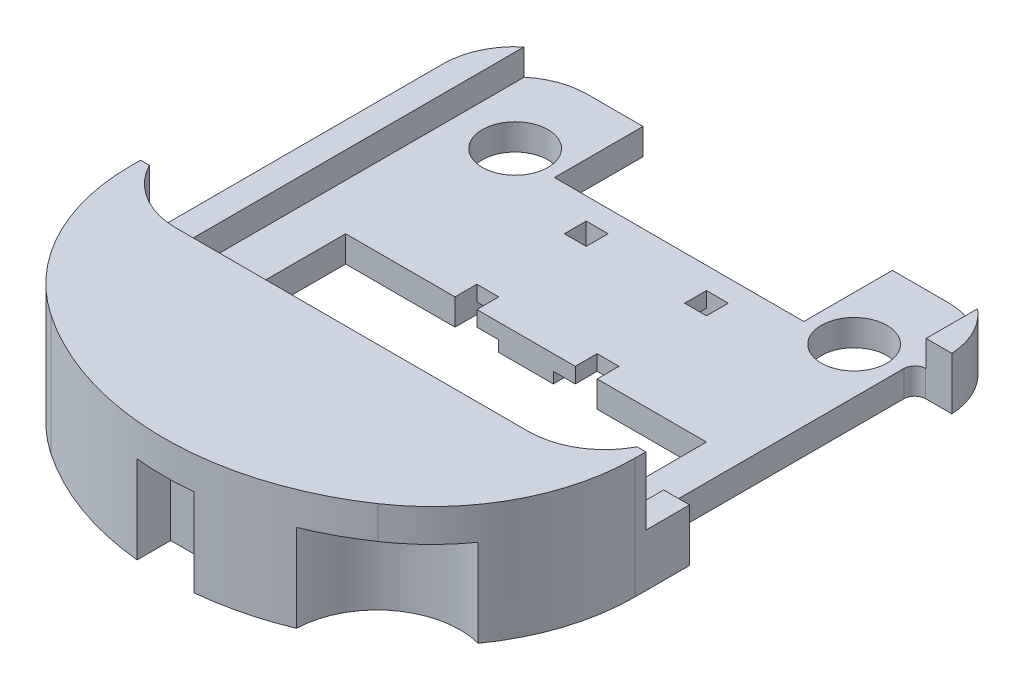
ISO-10303-21;
HEADER;
FILE_DESCRIPTION(('STEP AP214'),'2;1');
FILE_NAME('part.step','',(''),(''),'','','');
FILE_SCHEMA(('AUTOMOTIVE_DESIGN { 1 0 10303 214 1 1 1 1 }'));
ENDSEC;
DATA;
#1=APPLICATION_CONTEXT('core data for automotive mechanical design processes');
#2=APPLICATION_PROTOCOL_DEFINITION('international standard','automotive_design',2000,#1);
#3=PRODUCT_CONTEXT('',#1,'mechanical');
#4=PRODUCT('Part','Part','',(#3));
#5=PRODUCT_RELATED_PRODUCT_CATEGORY('part','',(#4));
#6=PRODUCT_DEFINITION_FORMATION('','',#4);
#7=PRODUCT_DEFINITION_CONTEXT('part definition',#1,'design');
#8=PRODUCT_DEFINITION('design','',#6,#7);
#9=PRODUCT_DEFINITION_SHAPE('','',#8);
#10=(LENGTH_UNIT() NAMED_UNIT(*) SI_UNIT(.MILLI.,.METRE.));
#11=(NAMED_UNIT(*) PLANE_ANGLE_UNIT() SI_UNIT($,.RADIAN.));
#12=(NAMED_UNIT(*) SI_UNIT($,.STERADIAN.) SOLID_ANGLE_UNIT());
#13=UNCERTAINTY_MEASURE_WITH_UNIT(LENGTH_MEASURE(1.E-05),#10,'distance_accuracy_value','');
#14=(GEOMETRIC_REPRESENTATION_CONTEXT(3) GLOBAL_UNCERTAINTY_ASSIGNED_CONTEXT((#13)) GLOBAL_UNIT_ASSIGNED_CONTEXT((#10,
#11,#12)) REPRESENTATION_CONTEXT('',''));
#15=CARTESIAN_POINT('',(0.,0.,0.));
#16=DIRECTION('',(0.,0.,1.));
#17=DIRECTION('',(1.,0.,0.));
#18=AXIS2_PLACEMENT_3D('',#15,#16,#17);
#19=CARTESIAN_POINT('',(114.665866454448,11.9932604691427,-158.384006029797));
#20=DIRECTION('',(-1.,0.,0.));
#21=DIRECTION('',(0.,-1.,0.));
#22=AXIS2_PLACEMENT_3D('',#19,#20,#21);
#23=PLANE('',#22);
#24=DIRECTION('',(0.,-1.,0.));
#25=VECTOR('',#24,1.);
#26=CARTESIAN_POINT('',(114.665866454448,9.59226046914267,-161.231798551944));
#27=LINE('',#26,#25);
#28=CARTESIAN_POINT('',(114.665866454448,11.9932604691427,-161.231798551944));
#29=VERTEX_POINT('',#28);
#30=CARTESIAN_POINT('',(114.665866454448,10.7932604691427,-161.231798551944));
#31=VERTEX_POINT('',#30);
#32=EDGE_CURVE('E493',#29,#31,#27,.T.);
#33=ORIENTED_EDGE('',*,*,#32,.T.);
#34=DIRECTION('',(0.,0.,-1.));
#35=VECTOR('',#34,1.);
#36=CARTESIAN_POINT('',(114.665866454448,10.7932604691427,-158.384006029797));
#37=LINE('',#36,#35);
#38=CARTESIAN_POINT('',(114.665866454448,10.7932604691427,-158.233567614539));
#39=VERTEX_POINT('',#38);
#40=EDGE_CURVE('E505',#39,#31,#37,.T.);
#41=ORIENTED_EDGE('',*,*,#40,.F.);
#42=DIRECTION('',(0.,-1.,0.));
#43=VECTOR('',#42,1.);
#44=CARTESIAN_POINT('',(114.665866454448,11.9932604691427,-158.233567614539));
#45=LINE('',#44,#43);
#46=CARTESIAN_POINT('',(114.665866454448,11.9932604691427,-158.233567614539));
#47=VERTEX_POINT('',#46);
#48=EDGE_CURVE('E500',#47,#39,#45,.T.);
#49=ORIENTED_EDGE('',*,*,#48,.F.);
#50=DIRECTION('',(0.,0.,-1.));
#51=VECTOR('',#50,1.);
#52=CARTESIAN_POINT('',(114.665866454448,11.9932604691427,-172.853842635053));
#53=LINE('',#52,#51);
#54=EDGE_CURVE('E497',#47,#29,#53,.T.);
#55=ORIENTED_EDGE('',*,*,#54,.T.);
#56=EDGE_LOOP('',(#33,#41,#49,#55));
#57=FACE_BOUND('',#56,.T.);
#58=ADVANCED_FACE('F41',(#57),#23,.T.);
#59=CARTESIAN_POINT('',(112.348611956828,11.9932604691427,-160.856606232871));
#60=DIRECTION('',(0.,1.,0.));
#61=DIRECTION('',(0.,0.,1.));
#62=AXIS2_PLACEMENT_3D('',#59,#60,#61);
#63=PLANE('',#62);
#64=DIRECTION('',(1.,0.,0.));
#65=VECTOR('',#64,1.);
#66=CARTESIAN_POINT('',(115.848611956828,11.9932604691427,-161.231798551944));
#67=LINE('',#66,#65);
#68=CARTESIAN_POINT('',(115.848611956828,11.9932604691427,-161.231798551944));
#69=VERTEX_POINT('',#68);
#70=EDGE_CURVE('E484',#29,#69,#67,.T.);
#71=ORIENTED_EDGE('',*,*,#70,.F.);
#72=ORIENTED_EDGE('',*,*,#54,.F.);
#73=CARTESIAN_POINT('',(112.348611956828,11.9932604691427,-160.856606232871));
#74=DIRECTION('',(0.,-1.,0.));
#75=DIRECTION('',(0.,0.,1.));
#76=AXIS2_PLACEMENT_3D('',#73,#74,#75);
#77=CIRCLE('',#76,3.50000000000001);
#78=CARTESIAN_POINT('',(115.448611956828,11.9932604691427,-159.231798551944));
#79=VERTEX_POINT('',#78);
#80=EDGE_CURVE('E508',#79,#47,#77,.T.);
#81=ORIENTED_EDGE('',*,*,#80,.F.);
#82=DIRECTION('',(-1.,0.,0.));
#83=VECTOR('',#82,1.);
#84=CARTESIAN_POINT('',(115.448611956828,11.9932604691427,-159.231798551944));
#85=LINE('',#84,#83);
#86=CARTESIAN_POINT('',(115.848611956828,11.9932604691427,-159.231798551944));
#87=VERTEX_POINT('',#86);
#88=EDGE_CURVE('E711',#87,#79,#85,.T.);
#89=ORIENTED_EDGE('',*,*,#88,.F.);
#90=DIRECTION('',(0.,0.,1.));
#91=VECTOR('',#90,1.);
#92=CARTESIAN_POINT('',(115.848611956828,11.9932604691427,-173.056606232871));
#93=LINE('',#92,#91);
#94=EDGE_CURVE('E501',#69,#87,#93,.T.);
#95=ORIENTED_EDGE('',*,*,#94,.F.);
#96=EDGE_LOOP('',(#71,#72,#81,#89,#95));
#97=FACE_BOUND('',#96,.T.);
#98=ADVANCED_FACE('F1034',(#97),#63,.T.);
#99=DIRECTION('',(-1.,0.,0.));
#100=VECTOR('',#99,1.);
#101=CARTESIAN_POINT('',(115.848611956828,11.9932604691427,-173.231798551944));
#102=LINE('',#101,#100);
#103=CARTESIAN_POINT('',(115.843958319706,11.9932604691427,-173.231798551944));
#104=VERTEX_POINT('',#103);
#105=CARTESIAN_POINT('',(114.665866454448,11.9932604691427,-173.231798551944));
#106=VERTEX_POINT('',#105);
#107=EDGE_CURVE('E472',#104,#106,#102,.T.);
#108=ORIENTED_EDGE('',*,*,#107,.F.);
#109=CARTESIAN_POINT('',(112.548611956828,11.9932604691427,-173.056606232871));
#110=DIRECTION('',(0.,-1.,0.));
#111=DIRECTION('',(0.,0.,1.));
#112=AXIS2_PLACEMENT_3D('',#109,#110,#111);
#113=CIRCLE('',#112,3.3);
#114=CARTESIAN_POINT('',(114.665866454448,11.9932604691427,-175.587857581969));
#115=VERTEX_POINT('',#114);
#116=EDGE_CURVE('E496',#115,#104,#113,.T.);
#117=ORIENTED_EDGE('',*,*,#116,.F.);
#118=EDGE_CURVE('E490',#106,#115,#53,.T.);
#119=ORIENTED_EDGE('',*,*,#118,.F.);
#120=EDGE_LOOP('',(#108,#117,#119));
#121=FACE_BOUND('',#120,.T.);
#122=ADVANCED_FACE('F495',(#121),#63,.T.);
#123=CARTESIAN_POINT('',(96.0486119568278,9.59326046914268,-173.056606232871));
#124=DIRECTION('',(0.,1.,0.));
#125=DIRECTION('',(0.,0.,1.));
#126=AXIS2_PLACEMENT_3D('',#123,#124,#125);
#127=PLANE('',#126);
#128=DIRECTION('',(0.,0.,-1.));
#129=VECTOR('',#128,1.);
#130=CARTESIAN_POINT('',(105.548611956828,9.59326046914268,-165.306606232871));
#131=LINE('',#130,#129);
#132=CARTESIAN_POINT('',(105.548611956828,9.59326046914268,-165.306606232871));
#133=VERTEX_POINT('',#132);
#134=CARTESIAN_POINT('',(105.548611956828,9.59326046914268,-166.306606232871));
#135=VERTEX_POINT('',#134);
#136=EDGE_CURVE('E798',#133,#135,#131,.T.);
#137=ORIENTED_EDGE('',*,*,#136,.F.);
#138=DIRECTION('',(1.,0.,0.));
#139=VECTOR('',#138,1.);
#140=CARTESIAN_POINT('',(96.0486119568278,9.59326046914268,-165.306606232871));
#141=LINE('',#140,#139);
#142=CARTESIAN_POINT('',(103.048611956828,9.59326046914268,-165.306606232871));
#143=VERTEX_POINT('',#142);
#144=EDGE_CURVE('E765',#143,#133,#141,.T.);
#145=ORIENTED_EDGE('',*,*,#144,.F.);
#146=DIRECTION('',(0.,0.,1.));
#147=VECTOR('',#146,1.);
#148=CARTESIAN_POINT('',(103.048611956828,9.59326046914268,-165.306606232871));
#149=LINE('',#148,#147);
#150=CARTESIAN_POINT('',(103.048611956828,9.59326046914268,-166.306606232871));
#151=VERTEX_POINT('',#150);
#152=EDGE_CURVE('E795',#151,#143,#149,.T.);
#153=ORIENTED_EDGE('',*,*,#152,.F.);
#154=DIRECTION('',(-1.,0.,0.));
#155=VECTOR('',#154,1.);
#156=CARTESIAN_POINT('',(103.048611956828,9.59326046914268,-166.306606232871));
#157=LINE('',#156,#155);
#158=EDGE_CURVE('E799',#135,#151,#157,.T.);
#159=ORIENTED_EDGE('',*,*,#158,.F.);
#160=EDGE_LOOP('',(#137,#145,#153,#159));
#161=FACE_BOUND('',#160,.T.);
#162=ADVANCED_FACE('F1206',(#161),#127,.F.);
#163=CARTESIAN_POINT('',(0.,10.0932604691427,0.));
#164=DIRECTION('',(0.,-1.,0.));
#165=DIRECTION('',(0.,0.,-1.));
#166=AXIS2_PLACEMENT_3D('',#163,#164,#165);
#167=PLANE('',#166);
#168=DIRECTION('',(-1.,0.,0.));
#169=VECTOR('',#168,1.);
#170=CARTESIAN_POINT('',(103.048611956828,10.0932604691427,-170.306606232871));
#171=LINE('',#170,#169);
#172=CARTESIAN_POINT('',(105.548611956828,10.0932604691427,-170.306606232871));
#173=VERTEX_POINT('',#172);
#174=CARTESIAN_POINT('',(103.048611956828,10.0932604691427,-170.306606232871));
#175=VERTEX_POINT('',#174);
#176=EDGE_CURVE('E779',#173,#175,#171,.T.);
#177=ORIENTED_EDGE('',*,*,#176,.F.);
#178=DIRECTION('',(0.,0.,1.));
#179=VECTOR('',#178,1.);
#180=CARTESIAN_POINT('',(105.548611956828,10.0932604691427,-171.306606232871));
#181=LINE('',#180,#179);
#182=CARTESIAN_POINT('',(105.548611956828,10.0932604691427,-171.306606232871));
#183=VERTEX_POINT('',#182);
#184=EDGE_CURVE('E776',#183,#173,#181,.T.);
#185=ORIENTED_EDGE('',*,*,#184,.F.);
#186=DIRECTION('',(1.,0.,0.));
#187=VECTOR('',#186,1.);
#188=CARTESIAN_POINT('',(107.548611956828,10.0932604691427,-171.306606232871));
#189=LINE('',#188,#187);
#190=CARTESIAN_POINT('',(106.548611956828,10.0932604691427,-171.306606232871));
#191=VERTEX_POINT('',#190);
#192=EDGE_CURVE('E939',#183,#191,#189,.T.);
#193=ORIENTED_EDGE('',*,*,#192,.T.);
#194=DIRECTION('',(0.,0.,-1.));
#195=VECTOR('',#194,1.);
#196=CARTESIAN_POINT('',(106.548611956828,10.0932604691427,-171.306606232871));
#197=LINE('',#196,#195);
#198=CARTESIAN_POINT('',(106.548611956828,10.0932604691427,-170.306606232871));
#199=VERTEX_POINT('',#198);
#200=EDGE_CURVE('E921',#199,#191,#197,.T.);
#201=ORIENTED_EDGE('',*,*,#200,.F.);
#202=DIRECTION('',(-1.,0.,0.));
#203=VECTOR('',#202,1.);
#204=CARTESIAN_POINT('',(107.548611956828,10.0932604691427,-170.306606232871));
#205=LINE('',#204,#203);
#206=CARTESIAN_POINT('',(107.548611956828,10.0932604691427,-170.306606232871));
#207=VERTEX_POINT('',#206);
#208=EDGE_CURVE('E919',#207,#199,#205,.T.);
#209=ORIENTED_EDGE('',*,*,#208,.F.);
#210=DIRECTION('',(0.,0.,1.));
#211=VECTOR('',#210,1.);
#212=CARTESIAN_POINT('',(107.548611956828,10.0932604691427,-171.306606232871));
#213=LINE('',#212,#211);
#214=CARTESIAN_POINT('',(107.548611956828,10.0932604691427,-168.931606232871));
#215=VERTEX_POINT('',#214);
#216=EDGE_CURVE('E945',#207,#215,#213,.T.);
#217=ORIENTED_EDGE('',*,*,#216,.T.);
#218=DIRECTION('',(1.,0.,0.));
#219=VECTOR('',#218,1.);
#220=CARTESIAN_POINT('',(101.048611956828,10.0932604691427,-168.931606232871));
#221=LINE('',#220,#219);
#222=CARTESIAN_POINT('',(101.048611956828,10.0932604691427,-168.931606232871));
#223=VERTEX_POINT('',#222);
#224=EDGE_CURVE('E829',#223,#215,#221,.T.);
#225=ORIENTED_EDGE('',*,*,#224,.F.);
#226=DIRECTION('',(0.,0.,-1.));
#227=VECTOR('',#226,1.);
#228=CARTESIAN_POINT('',(101.048611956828,10.0932604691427,-171.306606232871));
#229=LINE('',#228,#227);
#230=CARTESIAN_POINT('',(101.048611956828,10.0932604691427,-170.306606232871));
#231=VERTEX_POINT('',#230);
#232=EDGE_CURVE('E940',#223,#231,#229,.T.);
#233=ORIENTED_EDGE('',*,*,#232,.T.);
#234=DIRECTION('',(-1.,0.,0.));
#235=VECTOR('',#234,1.);
#236=CARTESIAN_POINT('',(101.048611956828,10.0932604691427,-170.306606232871));
#237=LINE('',#236,#235);
#238=CARTESIAN_POINT('',(102.048611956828,10.0932604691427,-170.306606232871));
#239=VERTEX_POINT('',#238);
#240=EDGE_CURVE('E854',#239,#231,#237,.T.);
#241=ORIENTED_EDGE('',*,*,#240,.F.);
#242=DIRECTION('',(0.,0.,1.));
#243=VECTOR('',#242,1.);
#244=CARTESIAN_POINT('',(102.048611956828,10.0932604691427,-171.306606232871));
#245=LINE('',#244,#243);
#246=CARTESIAN_POINT('',(102.048611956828,10.0932604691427,-171.306606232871));
#247=VERTEX_POINT('',#246);
#248=EDGE_CURVE('E852',#247,#239,#245,.T.);
#249=ORIENTED_EDGE('',*,*,#248,.F.);
#250=CARTESIAN_POINT('',(103.048611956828,10.0932604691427,-171.306606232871));
#251=VERTEX_POINT('',#250);
#252=EDGE_CURVE('E941',#247,#251,#189,.T.);
#253=ORIENTED_EDGE('',*,*,#252,.T.);
#254=DIRECTION('',(0.,0.,-1.));
#255=VECTOR('',#254,1.);
#256=CARTESIAN_POINT('',(103.048611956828,10.0932604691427,-171.306606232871));
#257=LINE('',#256,#255);
#258=EDGE_CURVE('E764',#175,#251,#257,.T.);
#259=ORIENTED_EDGE('',*,*,#258,.F.);
#260=EDGE_LOOP('',(#177,#185,#193,#201,#209,#217,#225,#233,#241,#249,#253,#259));
#261=FACE_BOUND('',#260,.T.);
#262=ADVANCED_FACE('F1761',(#261),#167,.T.);
#263=CARTESIAN_POINT('',(107.548611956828,10.0932604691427,-171.306606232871));
#264=DIRECTION('',(0.,0.,-1.));
#265=DIRECTION('',(-1.,0.,0.));
#266=AXIS2_PLACEMENT_3D('',#263,#264,#265);
#267=PLANE('',#266);
#268=DIRECTION('',(0.,1.,0.));
#269=VECTOR('',#268,1.);
#270=CARTESIAN_POINT('',(105.548611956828,2.97415932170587,-171.306606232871));
#271=LINE('',#270,#269);
#272=CARTESIAN_POINT('',(105.548611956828,9.59326046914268,-171.306606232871));
#273=VERTEX_POINT('',#272);
#274=EDGE_CURVE('E788',#273,#183,#271,.T.);
#275=ORIENTED_EDGE('',*,*,#274,.F.);
#276=DIRECTION('',(1.,0.,0.));
#277=VECTOR('',#276,1.);
#278=CARTESIAN_POINT('',(107.548611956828,9.59326046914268,-171.306606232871));
#279=LINE('',#278,#277);
#280=CARTESIAN_POINT('',(107.548611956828,9.59326046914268,-171.306606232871));
#281=VERTEX_POINT('',#280);
#282=EDGE_CURVE('E956',#273,#281,#279,.T.);
#283=ORIENTED_EDGE('',*,*,#282,.T.);
#284=DIRECTION('',(0.,-1.,0.));
#285=VECTOR('',#284,1.);
#286=CARTESIAN_POINT('',(107.548611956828,10.0932604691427,-171.306606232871));
#287=LINE('',#286,#285);
#288=CARTESIAN_POINT('',(107.548611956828,10.7932604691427,-171.306606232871));
#289=VERTEX_POINT('',#288);
#290=EDGE_CURVE('E969',#289,#281,#287,.T.);
#291=ORIENTED_EDGE('',*,*,#290,.F.);
#292=DIRECTION('',(1.,0.,0.));
#293=VECTOR('',#292,1.);
#294=CARTESIAN_POINT('',(107.548611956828,10.7932604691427,-171.306606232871));
#295=LINE('',#294,#293);
#296=CARTESIAN_POINT('',(106.548611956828,10.7932604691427,-171.306606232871));
#297=VERTEX_POINT('',#296);
#298=EDGE_CURVE('E913',#297,#289,#295,.T.);
#299=ORIENTED_EDGE('',*,*,#298,.F.);
#300=DIRECTION('',(0.,-1.,0.));
#301=VECTOR('',#300,1.);
#302=CARTESIAN_POINT('',(106.548611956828,15.0942604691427,-171.306606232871));
#303=LINE('',#302,#301);
#304=EDGE_CURVE('E925',#297,#191,#303,.T.);
#305=ORIENTED_EDGE('',*,*,#304,.T.);
#306=ORIENTED_EDGE('',*,*,#192,.F.);
#307=EDGE_LOOP('',(#275,#283,#291,#299,#305,#306));
#308=FACE_BOUND('',#307,.T.);
#309=ADVANCED_FACE('F1767',(#308),#267,.F.);
#310=DIRECTION('',(0.,1.,0.));
#311=VECTOR('',#310,1.);
#312=CARTESIAN_POINT('',(103.048611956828,2.97415932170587,-171.306606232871));
#313=LINE('',#312,#311);
#314=CARTESIAN_POINT('',(103.048611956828,9.59326046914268,-171.306606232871));
#315=VERTEX_POINT('',#314);
#316=EDGE_CURVE('E791',#315,#251,#313,.T.);
#317=ORIENTED_EDGE('',*,*,#316,.T.);
#318=ORIENTED_EDGE('',*,*,#252,.F.);
#319=DIRECTION('',(0.,-1.,0.));
#320=VECTOR('',#319,1.);
#321=CARTESIAN_POINT('',(102.048611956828,15.0942604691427,-171.306606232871));
#322=LINE('',#321,#320);
#323=CARTESIAN_POINT('',(102.048611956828,10.7932604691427,-171.306606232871));
#324=VERTEX_POINT('',#323);
#325=EDGE_CURVE('E857',#324,#247,#322,.T.);
#326=ORIENTED_EDGE('',*,*,#325,.F.);
#327=DIRECTION('',(1.,0.,0.));
#328=VECTOR('',#327,1.);
#329=CARTESIAN_POINT('',(101.048611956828,10.7932604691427,-171.306606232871));
#330=LINE('',#329,#328);
#331=CARTESIAN_POINT('',(101.048611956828,10.7932604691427,-171.306606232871));
#332=VERTEX_POINT('',#331);
#333=EDGE_CURVE('E861',#332,#324,#330,.T.);
#334=ORIENTED_EDGE('',*,*,#333,.F.);
#335=DIRECTION('',(0.,-1.,0.));
#336=VECTOR('',#335,1.);
#337=CARTESIAN_POINT('',(101.048611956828,10.0932604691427,-171.306606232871));
#338=LINE('',#337,#336);
#339=CARTESIAN_POINT('',(101.048611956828,9.59326046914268,-171.306606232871));
#340=VERTEX_POINT('',#339);
#341=EDGE_CURVE('E952',#332,#340,#338,.T.);
#342=ORIENTED_EDGE('',*,*,#341,.T.);
#343=EDGE_CURVE('E957',#340,#315,#279,.T.);
#344=ORIENTED_EDGE('',*,*,#343,.T.);
#345=EDGE_LOOP('',(#317,#318,#326,#334,#342,#344));
#346=FACE_BOUND('',#345,.T.);
#347=ADVANCED_FACE('F1758',(#346),#267,.F.);
#348=DIRECTION('',(1.,0.,0.));
#349=VECTOR('',#348,1.);
#350=CARTESIAN_POINT('',(103.048611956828,10.0932604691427,-166.306606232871));
#351=LINE('',#350,#349);
#352=CARTESIAN_POINT('',(103.048611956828,10.0932604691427,-166.306606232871));
#353=VERTEX_POINT('',#352);
#354=CARTESIAN_POINT('',(105.548611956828,10.0932604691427,-166.306606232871));
#355=VERTEX_POINT('',#354);
#356=EDGE_CURVE('E808',#353,#355,#351,.T.);
#357=ORIENTED_EDGE('',*,*,#356,.F.);
#358=DIRECTION('',(0.,0.,-1.));
#359=VECTOR('',#358,1.);
#360=CARTESIAN_POINT('',(103.048611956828,10.0932604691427,-165.306606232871));
#361=LINE('',#360,#359);
#362=CARTESIAN_POINT('',(103.048611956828,10.0932604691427,-165.306606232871));
#363=VERTEX_POINT('',#362);
#364=EDGE_CURVE('E805',#363,#353,#361,.T.);
#365=ORIENTED_EDGE('',*,*,#364,.F.);
#366=DIRECTION('',(-1.,0.,0.));
#367=VECTOR('',#366,1.);
#368=CARTESIAN_POINT('',(107.548611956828,10.0932604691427,-165.306606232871));
#369=LINE('',#368,#367);
#370=CARTESIAN_POINT('',(102.048611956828,10.0932604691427,-165.306606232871));
#371=VERTEX_POINT('',#370);
#372=EDGE_CURVE('E948',#363,#371,#369,.T.);
#373=ORIENTED_EDGE('',*,*,#372,.T.);
#374=DIRECTION('',(0.,0.,1.));
#375=VECTOR('',#374,1.);
#376=CARTESIAN_POINT('',(102.048611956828,10.0932604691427,-165.306606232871));
#377=LINE('',#376,#375);
#378=CARTESIAN_POINT('',(102.048611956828,10.0932604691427,-166.306606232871));
#379=VERTEX_POINT('',#378);
#380=EDGE_CURVE('E878',#379,#371,#377,.T.);
#381=ORIENTED_EDGE('',*,*,#380,.F.);
#382=DIRECTION('',(1.,0.,0.));
#383=VECTOR('',#382,1.);
#384=CARTESIAN_POINT('',(101.048611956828,10.0932604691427,-166.306606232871));
#385=LINE('',#384,#383);
#386=CARTESIAN_POINT('',(101.048611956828,10.0932604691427,-166.306606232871));
#387=VERTEX_POINT('',#386);
#388=EDGE_CURVE('E876',#387,#379,#385,.T.);
#389=ORIENTED_EDGE('',*,*,#388,.F.);
#390=CARTESIAN_POINT('',(101.048611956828,10.0932604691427,-167.681606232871));
#391=VERTEX_POINT('',#390);
#392=EDGE_CURVE('E936',#387,#391,#229,.T.);
#393=ORIENTED_EDGE('',*,*,#392,.T.);
#394=DIRECTION('',(-1.,0.,0.));
#395=VECTOR('',#394,1.);
#396=CARTESIAN_POINT('',(101.048611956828,10.0932604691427,-167.681606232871));
#397=LINE('',#396,#395);
#398=CARTESIAN_POINT('',(107.548611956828,10.0932604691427,-167.681606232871));
#399=VERTEX_POINT('',#398);
#400=EDGE_CURVE('E802',#399,#391,#397,.T.);
#401=ORIENTED_EDGE('',*,*,#400,.F.);
#402=CARTESIAN_POINT('',(107.548611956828,10.0932604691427,-166.306606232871));
#403=VERTEX_POINT('',#402);
#404=EDGE_CURVE('E944',#399,#403,#213,.T.);
#405=ORIENTED_EDGE('',*,*,#404,.T.);
#406=DIRECTION('',(1.,0.,0.));
#407=VECTOR('',#406,1.);
#408=CARTESIAN_POINT('',(107.548611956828,10.0932604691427,-166.306606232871));
#409=LINE('',#408,#407);
#410=CARTESIAN_POINT('',(106.548611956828,10.0932604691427,-166.306606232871));
#411=VERTEX_POINT('',#410);
#412=EDGE_CURVE('E900',#411,#403,#409,.T.);
#413=ORIENTED_EDGE('',*,*,#412,.F.);
#414=DIRECTION('',(0.,0.,-1.));
#415=VECTOR('',#414,1.);
#416=CARTESIAN_POINT('',(106.548611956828,10.0932604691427,-165.306606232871));
#417=LINE('',#416,#415);
#418=CARTESIAN_POINT('',(106.548611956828,10.0932604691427,-165.306606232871));
#419=VERTEX_POINT('',#418);
#420=EDGE_CURVE('E898',#419,#411,#417,.T.);
#421=ORIENTED_EDGE('',*,*,#420,.F.);
#422=CARTESIAN_POINT('',(105.548611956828,10.0932604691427,-165.306606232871));
#423=VERTEX_POINT('',#422);
#424=EDGE_CURVE('E949',#419,#423,#369,.T.);
#425=ORIENTED_EDGE('',*,*,#424,.T.);
#426=DIRECTION('',(0.,0.,1.));
#427=VECTOR('',#426,1.);
#428=CARTESIAN_POINT('',(105.548611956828,10.0932604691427,-165.306606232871));
#429=LINE('',#428,#427);
#430=EDGE_CURVE('E773',#355,#423,#429,.T.);
#431=ORIENTED_EDGE('',*,*,#430,.F.);
#432=EDGE_LOOP('',(#357,#365,#373,#381,#389,#393,#401,#405,#413,#421,#425,#431));
#433=FACE_BOUND('',#432,.T.);
#434=ADVANCED_FACE('F1744',(#433),#167,.T.);
#435=CARTESIAN_POINT('',(101.048611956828,10.0932604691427,-171.306606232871));
#436=DIRECTION('',(-1.,0.,0.));
#437=DIRECTION('',(0.,0.,1.));
#438=AXIS2_PLACEMENT_3D('',#435,#436,#437);
#439=PLANE('',#438);
#440=DIRECTION('',(0.,1.,0.));
#441=VECTOR('',#440,1.);
#442=CARTESIAN_POINT('',(101.048611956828,2.97415932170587,-168.931606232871));
#443=LINE('',#442,#441);
#444=CARTESIAN_POINT('',(101.048611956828,9.59326046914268,-168.931606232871));
#445=VERTEX_POINT('',#444);
#446=EDGE_CURVE('E834',#445,#223,#443,.T.);
#447=ORIENTED_EDGE('',*,*,#446,.F.);
#448=DIRECTION('',(0.,0.,-1.));
#449=VECTOR('',#448,1.);
#450=CARTESIAN_POINT('',(101.048611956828,9.59326046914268,-171.306606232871));
#451=LINE('',#450,#449);
#452=EDGE_CURVE('E935',#445,#340,#451,.T.);
#453=ORIENTED_EDGE('',*,*,#452,.T.);
#454=ORIENTED_EDGE('',*,*,#341,.F.);
#455=DIRECTION('',(0.,0.,-1.));
#456=VECTOR('',#455,1.);
#457=CARTESIAN_POINT('',(101.048611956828,10.7932604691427,-171.306606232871));
#458=LINE('',#457,#456);
#459=CARTESIAN_POINT('',(101.048611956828,10.7932604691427,-170.306606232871));
#460=VERTEX_POINT('',#459);
#461=EDGE_CURVE('E849',#460,#332,#458,.T.);
#462=ORIENTED_EDGE('',*,*,#461,.F.);
#463=DIRECTION('',(0.,-1.,0.));
#464=VECTOR('',#463,1.);
#465=CARTESIAN_POINT('',(101.048611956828,15.0942604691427,-170.306606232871));
#466=LINE('',#465,#464);
#467=EDGE_CURVE('E858',#460,#231,#466,.T.);
#468=ORIENTED_EDGE('',*,*,#467,.T.);
#469=ORIENTED_EDGE('',*,*,#232,.F.);
#470=EDGE_LOOP('',(#447,#453,#454,#462,#468,#469));
#471=FACE_BOUND('',#470,.T.);
#472=ADVANCED_FACE('F1729',(#471),#439,.F.);
#473=DIRECTION('',(0.,1.,0.));
#474=VECTOR('',#473,1.);
#475=CARTESIAN_POINT('',(101.048611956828,2.97415932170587,-167.681606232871));
#476=LINE('',#475,#474);
#477=CARTESIAN_POINT('',(101.048611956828,9.59326046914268,-167.681606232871));
#478=VERTEX_POINT('',#477);
#479=EDGE_CURVE('E836',#478,#391,#476,.T.);
#480=ORIENTED_EDGE('',*,*,#479,.T.);
#481=ORIENTED_EDGE('',*,*,#392,.F.);
#482=DIRECTION('',(0.,-1.,0.));
#483=VECTOR('',#482,1.);
#484=CARTESIAN_POINT('',(101.048611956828,15.0942604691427,-166.306606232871));
#485=LINE('',#484,#483);
#486=CARTESIAN_POINT('',(101.048611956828,10.7932604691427,-166.306606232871));
#487=VERTEX_POINT('',#486);
#488=EDGE_CURVE('E881',#487,#387,#485,.T.);
#489=ORIENTED_EDGE('',*,*,#488,.F.);
#490=DIRECTION('',(0.,0.,-1.));
#491=VECTOR('',#490,1.);
#492=CARTESIAN_POINT('',(101.048611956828,10.7932604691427,-165.306606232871));
#493=LINE('',#492,#491);
#494=CARTESIAN_POINT('',(101.048611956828,10.7932604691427,-165.306606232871));
#495=VERTEX_POINT('',#494);
#496=EDGE_CURVE('E872',#495,#487,#493,.T.);
#497=ORIENTED_EDGE('',*,*,#496,.F.);
#498=DIRECTION('',(0.,-1.,0.));
#499=VECTOR('',#498,1.);
#500=CARTESIAN_POINT('',(101.048611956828,10.0932604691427,-165.306606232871));
#501=LINE('',#500,#499);
#502=CARTESIAN_POINT('',(101.048611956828,9.59326046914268,-165.306606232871));
#503=VERTEX_POINT('',#502);
#504=EDGE_CURVE('E963',#495,#503,#501,.T.);
#505=ORIENTED_EDGE('',*,*,#504,.T.);
#506=EDGE_CURVE('E953',#503,#478,#451,.T.);
#507=ORIENTED_EDGE('',*,*,#506,.T.);
#508=EDGE_LOOP('',(#480,#481,#489,#497,#505,#507));
#509=FACE_BOUND('',#508,.T.);
#510=ADVANCED_FACE('F1715',(#509),#439,.F.);
#511=CARTESIAN_POINT('',(107.548611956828,10.0932604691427,-171.306606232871));
#512=DIRECTION('',(1.,0.,0.));
#513=DIRECTION('',(0.,0.,-1.));
#514=AXIS2_PLACEMENT_3D('',#511,#512,#513);
#515=PLANE('',#514);
#516=DIRECTION('',(0.,1.,0.));
#517=VECTOR('',#516,1.);
#518=CARTESIAN_POINT('',(107.548611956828,2.97415932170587,-168.931606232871));
#519=LINE('',#518,#517);
#520=CARTESIAN_POINT('',(107.548611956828,9.59326046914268,-168.931606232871));
#521=VERTEX_POINT('',#520);
#522=EDGE_CURVE('E831',#521,#215,#519,.T.);
#523=ORIENTED_EDGE('',*,*,#522,.T.);
#524=ORIENTED_EDGE('',*,*,#216,.F.);
#525=DIRECTION('',(0.,-1.,0.));
#526=VECTOR('',#525,1.);
#527=CARTESIAN_POINT('',(107.548611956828,15.0942604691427,-170.306606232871));
#528=LINE('',#527,#526);
#529=CARTESIAN_POINT('',(107.548611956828,10.7932604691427,-170.306606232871));
#530=VERTEX_POINT('',#529);
#531=EDGE_CURVE('E924',#530,#207,#528,.T.);
#532=ORIENTED_EDGE('',*,*,#531,.F.);
#533=DIRECTION('',(0.,0.,1.));
#534=VECTOR('',#533,1.);
#535=CARTESIAN_POINT('',(107.548611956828,10.7932604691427,-171.306606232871));
#536=LINE('',#535,#534);
#537=EDGE_CURVE('E916',#289,#530,#536,.T.);
#538=ORIENTED_EDGE('',*,*,#537,.F.);
#539=ORIENTED_EDGE('',*,*,#290,.T.);
#540=DIRECTION('',(0.,0.,1.));
#541=VECTOR('',#540,1.);
#542=CARTESIAN_POINT('',(107.548611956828,9.59326046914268,-171.306606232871));
#543=LINE('',#542,#541);
#544=EDGE_CURVE('E960',#281,#521,#543,.T.);
#545=ORIENTED_EDGE('',*,*,#544,.T.);
#546=EDGE_LOOP('',(#523,#524,#532,#538,#539,#545));
#547=FACE_BOUND('',#546,.T.);
#548=ADVANCED_FACE('F1701',(#547),#515,.F.);
#549=DIRECTION('',(0.,1.,0.));
#550=VECTOR('',#549,1.);
#551=CARTESIAN_POINT('',(107.548611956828,2.97415932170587,-167.681606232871));
#552=LINE('',#551,#550);
#553=CARTESIAN_POINT('',(107.548611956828,9.59326046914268,-167.681606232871));
#554=VERTEX_POINT('',#553);
#555=EDGE_CURVE('E839',#554,#399,#552,.T.);
#556=ORIENTED_EDGE('',*,*,#555,.F.);
#557=CARTESIAN_POINT('',(107.548611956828,9.59326046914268,-165.306606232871));
#558=VERTEX_POINT('',#557);
#559=EDGE_CURVE('E959',#554,#558,#543,.T.);
#560=ORIENTED_EDGE('',*,*,#559,.T.);
#561=DIRECTION('',(0.,-1.,0.));
#562=VECTOR('',#561,1.);
#563=CARTESIAN_POINT('',(107.548611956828,10.0932604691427,-165.306606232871));
#564=LINE('',#563,#562);
#565=CARTESIAN_POINT('',(107.548611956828,10.7932604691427,-165.306606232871));
#566=VERTEX_POINT('',#565);
#567=EDGE_CURVE('E967',#566,#558,#564,.T.);
#568=ORIENTED_EDGE('',*,*,#567,.F.);
#569=DIRECTION('',(0.,0.,1.));
#570=VECTOR('',#569,1.);
#571=CARTESIAN_POINT('',(107.548611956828,10.7932604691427,-165.306606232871));
#572=LINE('',#571,#570);
#573=CARTESIAN_POINT('',(107.548611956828,10.7932604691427,-166.306606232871));
#574=VERTEX_POINT('',#573);
#575=EDGE_CURVE('E895',#574,#566,#572,.T.);
#576=ORIENTED_EDGE('',*,*,#575,.F.);
#577=DIRECTION('',(0.,-1.,0.));
#578=VECTOR('',#577,1.);
#579=CARTESIAN_POINT('',(107.548611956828,15.0942604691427,-166.306606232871));
#580=LINE('',#579,#578);
#581=EDGE_CURVE('E873',#574,#403,#580,.T.);
#582=ORIENTED_EDGE('',*,*,#581,.T.);
#583=ORIENTED_EDGE('',*,*,#404,.F.);
#584=EDGE_LOOP('',(#556,#560,#568,#576,#582,#583));
#585=FACE_BOUND('',#584,.T.);
#586=ADVANCED_FACE('F1299',(#585),#515,.F.);
#587=CARTESIAN_POINT('',(112.548611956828,15.0932604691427,-176.356606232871));
#588=DIRECTION('',(0.,0.,1.));
#589=DIRECTION('',(1.,0.,0.));
#590=AXIS2_PLACEMENT_3D('',#587,#588,#589);
#591=PLANE('',#590);
#592=DIRECTION('',(-1.,0.,0.));
#593=VECTOR('',#592,1.);
#594=CARTESIAN_POINT('',(112.548611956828,10.7932604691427,-176.356606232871));
#595=LINE('',#594,#593);
#596=CARTESIAN_POINT('',(98.5986119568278,10.7932604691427,-176.356606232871));
#597=VERTEX_POINT('',#596);
#598=CARTESIAN_POINT('',(96.0486119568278,10.7932604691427,-176.356606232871));
#599=VERTEX_POINT('',#598);
#600=EDGE_CURVE('E532',#597,#599,#595,.T.);
#601=ORIENTED_EDGE('',*,*,#600,.F.);
#602=DIRECTION('',(0.,-1.,0.));
#603=VECTOR('',#602,1.);
#604=CARTESIAN_POINT('',(98.5986119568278,15.0932604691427,-176.356606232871));
#605=LINE('',#604,#603);
#606=CARTESIAN_POINT('',(98.5986119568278,9.59326046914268,-176.356606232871));
#607=VERTEX_POINT('',#606);
#608=EDGE_CURVE('E1013',#597,#607,#605,.T.);
#609=ORIENTED_EDGE('',*,*,#608,.T.);
#610=DIRECTION('',(-1.,0.,0.));
#611=VECTOR('',#610,1.);
#612=CARTESIAN_POINT('',(112.548611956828,9.59326046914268,-176.356606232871));
#613=LINE('',#612,#611);
#614=CARTESIAN_POINT('',(96.0486119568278,9.59326046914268,-176.356606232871));
#615=VERTEX_POINT('',#614);
#616=EDGE_CURVE('E597',#607,#615,#613,.T.);
#617=ORIENTED_EDGE('',*,*,#616,.T.);
#618=DIRECTION('',(0.,-1.,0.));
#619=VECTOR('',#618,1.);
#620=CARTESIAN_POINT('',(96.0486119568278,15.0932604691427,-176.356606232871));
#621=LINE('',#620,#619);
#622=EDGE_CURVE('E579',#599,#615,#621,.T.);
#623=ORIENTED_EDGE('',*,*,#622,.F.);
#624=EDGE_LOOP('',(#601,#609,#617,#623));
#625=FACE_BOUND('',#624,.T.);
#626=ADVANCED_FACE('F1134',(#625),#591,.F.);
#627=CARTESIAN_POINT('',(112.548611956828,10.7932604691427,-173.056606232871));
#628=DIRECTION('',(0.,1.,0.));
#629=DIRECTION('',(0.,0.,1.));
#630=AXIS2_PLACEMENT_3D('',#627,#628,#629);
#631=PLANE('',#630);
#632=DIRECTION('',(-1.,0.,0.));
#633=VECTOR('',#632,1.);
#634=CARTESIAN_POINT('',(115.848611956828,10.7932604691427,-161.231798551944));
#635=LINE('',#634,#633);
#636=CARTESIAN_POINT('',(114.648611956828,10.7932604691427,-161.231798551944));
#637=VERTEX_POINT('',#636);
#638=EDGE_CURVE('E485',#31,#637,#635,.T.);
#639=ORIENTED_EDGE('',*,*,#638,.T.);
#640=CARTESIAN_POINT('',(114.648611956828,10.7932604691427,-161.731798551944));
#641=DIRECTION('',(0.,1.,0.));
#642=DIRECTION('',(0.,0.,1.));
#643=AXIS2_PLACEMENT_3D('',#640,#641,#642);
#644=CIRCLE('',#643,0.5);
#645=CARTESIAN_POINT('',(114.148611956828,10.7932604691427,-161.731798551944));
#646=VERTEX_POINT('',#645);
#647=EDGE_CURVE('E49',#637,#646,#644,.F.);
#648=ORIENTED_EDGE('',*,*,#647,.T.);
#649=DIRECTION('',(0.,0.,-1.));
#650=VECTOR('',#649,1.);
#651=CARTESIAN_POINT('',(114.148611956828,10.7932604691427,-173.231798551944));
#652=LINE('',#651,#650);
#653=CARTESIAN_POINT('',(114.148611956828,10.7932604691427,-172.731798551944));
#654=VERTEX_POINT('',#653);
#655=EDGE_CURVE('E657',#646,#654,#652,.T.);
#656=ORIENTED_EDGE('',*,*,#655,.T.);
#657=CARTESIAN_POINT('',(114.648611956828,10.7932604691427,-172.731798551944));
#658=DIRECTION('',(0.,1.,0.));
#659=DIRECTION('',(0.,0.,1.));
#660=AXIS2_PLACEMENT_3D('',#657,#658,#659);
#661=CIRCLE('',#660,0.5);
#662=CARTESIAN_POINT('',(114.648611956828,10.7932604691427,-173.231798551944));
#663=VERTEX_POINT('',#662);
#664=EDGE_CURVE('E648',#654,#663,#661,.F.);
#665=ORIENTED_EDGE('',*,*,#664,.T.);
#666=DIRECTION('',(1.,0.,0.));
#667=VECTOR('',#666,1.);
#668=CARTESIAN_POINT('',(115.848611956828,10.7932604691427,-173.231798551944));
#669=LINE('',#668,#667);
#670=CARTESIAN_POINT('',(114.665866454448,10.7932604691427,-173.231798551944));
#671=VERTEX_POINT('',#670);
#672=EDGE_CURVE('E678',#663,#671,#669,.T.);
#673=ORIENTED_EDGE('',*,*,#672,.T.);
#674=CARTESIAN_POINT('',(114.665866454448,10.7932604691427,-175.587857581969));
#675=VERTEX_POINT('',#674);
#676=EDGE_CURVE('E492',#671,#675,#37,.T.);
#677=ORIENTED_EDGE('',*,*,#676,.T.);
#678=CARTESIAN_POINT('',(112.548611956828,10.7932604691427,-173.056606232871));
#679=DIRECTION('',(0.,1.,0.));
#680=DIRECTION('',(0.,0.,1.));
#681=AXIS2_PLACEMENT_3D('',#678,#679,#680);
#682=CIRCLE('',#681,3.3);
#683=CARTESIAN_POINT('',(112.548611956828,10.7932604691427,-176.356606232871));
#684=VERTEX_POINT('',#683);
#685=EDGE_CURVE('E530',#675,#684,#682,.T.);
#686=ORIENTED_EDGE('',*,*,#685,.T.);
#687=CARTESIAN_POINT('',(109.998611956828,10.7932604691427,-176.356606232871));
#688=VERTEX_POINT('',#687);
#689=EDGE_CURVE('E534',#684,#688,#595,.T.);
#690=ORIENTED_EDGE('',*,*,#689,.T.);
#691=DIRECTION('',(0.,0.,-1.));
#692=VECTOR('',#691,1.);
#693=CARTESIAN_POINT('',(109.998611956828,10.7932604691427,-173.056606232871));
#694=LINE('',#693,#692);
#695=CARTESIAN_POINT('',(109.998611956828,10.7932604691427,-172.306606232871));
#696=VERTEX_POINT('',#695);
#697=EDGE_CURVE('E1011',#696,#688,#694,.T.);
#698=ORIENTED_EDGE('',*,*,#697,.F.);
#699=DIRECTION('',(-1.,0.,0.));
#700=VECTOR('',#699,1.);
#701=CARTESIAN_POINT('',(98.5986119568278,10.7932604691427,-172.306606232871));
#702=LINE('',#701,#700);
#703=CARTESIAN_POINT('',(98.5986119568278,10.7932604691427,-172.306606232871));
#704=VERTEX_POINT('',#703);
#705=EDGE_CURVE('E714',#696,#704,#702,.T.);
#706=ORIENTED_EDGE('',*,*,#705,.T.);
#707=DIRECTION('',(0.,0.,1.));
#708=VECTOR('',#707,1.);
#709=CARTESIAN_POINT('',(98.5986119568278,10.7932604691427,-173.056606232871));
#710=LINE('',#709,#708);
#711=EDGE_CURVE('E1016',#597,#704,#710,.T.);
#712=ORIENTED_EDGE('',*,*,#711,.F.);
#713=ORIENTED_EDGE('',*,*,#600,.T.);
#714=CARTESIAN_POINT('',(96.0486119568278,10.7932604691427,-173.056606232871));
#715=DIRECTION('',(0.,1.,0.));
#716=DIRECTION('',(0.,0.,1.));
#717=AXIS2_PLACEMENT_3D('',#714,#715,#716);
#718=CIRCLE('',#717,3.3);
#719=CARTESIAN_POINT('',(93.9313574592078,10.7932604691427,-175.587857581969));
#720=VERTEX_POINT('',#719);
#721=EDGE_CURVE('E537',#599,#720,#718,.T.);
#722=ORIENTED_EDGE('',*,*,#721,.T.);
#723=DIRECTION('',(0.,0.,-1.));
#724=VECTOR('',#723,1.);
#725=CARTESIAN_POINT('',(93.9313574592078,10.7932604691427,-172.853842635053));
#726=LINE('',#725,#724);
#727=CARTESIAN_POINT('',(93.9313574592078,10.7932604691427,-158.233567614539));
#728=VERTEX_POINT('',#727);
#729=EDGE_CURVE('E513',#728,#720,#726,.T.);
#730=ORIENTED_EDGE('',*,*,#729,.F.);
#731=CARTESIAN_POINT('',(96.2486119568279,10.7932604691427,-160.856606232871));
#732=DIRECTION('',(0.,1.,0.));
#733=DIRECTION('',(0.,0.,1.));
#734=AXIS2_PLACEMENT_3D('',#731,#732,#733);
#735=CIRCLE('',#734,3.50000000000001);
#736=CARTESIAN_POINT('',(96.0486119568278,10.7932604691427,-157.36232519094));
#737=VERTEX_POINT('',#736);
#738=EDGE_CURVE('E540',#728,#737,#735,.T.);
#739=ORIENTED_EDGE('',*,*,#738,.T.);
#740=DIRECTION('',(0.,0.,1.));
#741=VECTOR('',#740,1.);
#742=CARTESIAN_POINT('',(96.0486119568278,10.7932604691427,-165.306606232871));
#743=LINE('',#742,#741);
#744=CARTESIAN_POINT('',(96.0486119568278,10.7932604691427,-165.306606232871));
#745=VERTEX_POINT('',#744);
#746=EDGE_CURVE('E748',#745,#737,#743,.T.);
#747=ORIENTED_EDGE('',*,*,#746,.F.);
#748=DIRECTION('',(-1.,0.,0.));
#749=VECTOR('',#748,1.);
#750=CARTESIAN_POINT('',(96.0486119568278,10.7932604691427,-165.306606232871));
#751=LINE('',#750,#749);
#752=EDGE_CURVE('E745',#495,#745,#751,.T.);
#753=ORIENTED_EDGE('',*,*,#752,.F.);
#754=ORIENTED_EDGE('',*,*,#496,.T.);
#755=DIRECTION('',(1.,0.,0.));
#756=VECTOR('',#755,1.);
#757=CARTESIAN_POINT('',(101.048611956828,10.7932604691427,-166.306606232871));
#758=LINE('',#757,#756);
#759=CARTESIAN_POINT('',(102.048611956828,10.7932604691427,-166.306606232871));
#760=VERTEX_POINT('',#759);
#761=EDGE_CURVE('E846',#487,#760,#758,.T.);
#762=ORIENTED_EDGE('',*,*,#761,.T.);
#763=DIRECTION('',(0.,0.,1.));
#764=VECTOR('',#763,1.);
#765=CARTESIAN_POINT('',(102.048611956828,10.7932604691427,-165.306606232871));
#766=LINE('',#765,#764);
#767=CARTESIAN_POINT('',(102.048611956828,10.7932604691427,-165.306606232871));
#768=VERTEX_POINT('',#767);
#769=EDGE_CURVE('E869',#760,#768,#766,.T.);
#770=ORIENTED_EDGE('',*,*,#769,.T.);
#771=CARTESIAN_POINT('',(106.548611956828,10.7932604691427,-165.306606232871));
#772=VERTEX_POINT('',#771);
#773=EDGE_CURVE('E749',#772,#768,#751,.T.);
#774=ORIENTED_EDGE('',*,*,#773,.F.);
#775=DIRECTION('',(0.,0.,-1.));
#776=VECTOR('',#775,1.);
#777=CARTESIAN_POINT('',(106.548611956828,10.7932604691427,-165.306606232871));
#778=LINE('',#777,#776);
#779=CARTESIAN_POINT('',(106.548611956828,10.7932604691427,-166.306606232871));
#780=VERTEX_POINT('',#779);
#781=EDGE_CURVE('E826',#772,#780,#778,.T.);
#782=ORIENTED_EDGE('',*,*,#781,.T.);
#783=DIRECTION('',(1.,0.,0.));
#784=VECTOR('',#783,1.);
#785=CARTESIAN_POINT('',(107.548611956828,10.7932604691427,-166.306606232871));
#786=LINE('',#785,#784);
#787=EDGE_CURVE('E892',#780,#574,#786,.T.);
#788=ORIENTED_EDGE('',*,*,#787,.T.);
#789=ORIENTED_EDGE('',*,*,#575,.T.);
#790=CARTESIAN_POINT('',(112.548611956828,10.7932604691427,-165.306606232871));
#791=VERTEX_POINT('',#790);
#792=EDGE_CURVE('E746',#791,#566,#751,.T.);
#793=ORIENTED_EDGE('',*,*,#792,.F.);
#794=DIRECTION('',(0.,0.,-1.));
#795=VECTOR('',#794,1.);
#796=CARTESIAN_POINT('',(112.548611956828,10.7932604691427,-165.306606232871));
#797=LINE('',#796,#795);
#798=CARTESIAN_POINT('',(112.548611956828,10.7932604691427,-157.36232519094));
#799=VERTEX_POINT('',#798);
#800=EDGE_CURVE('E743',#799,#791,#797,.T.);
#801=ORIENTED_EDGE('',*,*,#800,.F.);
#802=CARTESIAN_POINT('',(112.348611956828,10.7932604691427,-160.856606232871));
#803=DIRECTION('',(0.,1.,0.));
#804=DIRECTION('',(0.,0.,1.));
#805=AXIS2_PLACEMENT_3D('',#802,#803,#804);
#806=CIRCLE('',#805,3.5);
#807=EDGE_CURVE('E543',#799,#39,#806,.T.);
#808=ORIENTED_EDGE('',*,*,#807,.T.);
#809=ORIENTED_EDGE('',*,*,#40,.T.);
#810=EDGE_LOOP('',(#639,#648,#656,#665,#673,#677,#686,#690,#698,#706,#712,#713,#722,#730,#739,
#747,#753,#754,#762,#770,#774,#782,#788,#789,#793,#801,#808,#809));
#811=FACE_BOUND('',#810,.T.);
#812=ORIENTED_EDGE('',*,*,#461,.T.);
#813=ORIENTED_EDGE('',*,*,#333,.T.);
#814=DIRECTION('',(0.,0.,1.));
#815=VECTOR('',#814,1.);
#816=CARTESIAN_POINT('',(102.048611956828,10.7932604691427,-171.306606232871));
#817=LINE('',#816,#815);
#818=CARTESIAN_POINT('',(102.048611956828,10.7932604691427,-170.306606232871));
#819=VERTEX_POINT('',#818);
#820=EDGE_CURVE('E842',#324,#819,#817,.T.);
#821=ORIENTED_EDGE('',*,*,#820,.T.);
#822=DIRECTION('',(-1.,0.,0.));
#823=VECTOR('',#822,1.);
#824=CARTESIAN_POINT('',(101.048611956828,10.7932604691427,-170.306606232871));
#825=LINE('',#824,#823);
#826=EDGE_CURVE('E845',#819,#460,#825,.T.);
#827=ORIENTED_EDGE('',*,*,#826,.T.);
#828=EDGE_LOOP('',(#812,#813,#821,#827));
#829=FACE_BOUND('',#828,.T.);
#830=ORIENTED_EDGE('',*,*,#537,.T.);
#831=DIRECTION('',(-1.,0.,0.));
#832=VECTOR('',#831,1.);
#833=CARTESIAN_POINT('',(107.548611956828,10.7932604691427,-170.306606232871));
#834=LINE('',#833,#832);
#835=CARTESIAN_POINT('',(106.548611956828,10.7932604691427,-170.306606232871));
#836=VERTEX_POINT('',#835);
#837=EDGE_CURVE('E928',#530,#836,#834,.T.);
#838=ORIENTED_EDGE('',*,*,#837,.T.);
#839=DIRECTION('',(0.,0.,-1.));
#840=VECTOR('',#839,1.);
#841=CARTESIAN_POINT('',(106.548611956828,10.7932604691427,-171.306606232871));
#842=LINE('',#841,#840);
#843=EDGE_CURVE('E868',#836,#297,#842,.T.);
#844=ORIENTED_EDGE('',*,*,#843,.T.);
#845=ORIENTED_EDGE('',*,*,#298,.T.);
#846=EDGE_LOOP('',(#830,#838,#844,#845));
#847=FACE_BOUND('',#846,.T.);
#848=CARTESIAN_POINT('',(96.5486119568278,10.7932604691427,-172.556606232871));
#849=DIRECTION('',(0.,1.,0.));
#850=DIRECTION('',(0.,0.,1.));
#851=AXIS2_PLACEMENT_3D('',#848,#849,#850);
#852=CIRCLE('',#851,1.5);
#853=CARTESIAN_POINT('',(96.5486119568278,10.7932604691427,-171.056606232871));
#854=VERTEX_POINT('',#853);
#855=EDGE_CURVE('E555',#854,#854,#852,.F.);
#856=ORIENTED_EDGE('',*,*,#855,.T.);
#857=EDGE_LOOP('',(#856));
#858=FACE_BOUND('',#857,.T.);
#859=CARTESIAN_POINT('',(112.048611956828,10.7932604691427,-172.556606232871));
#860=DIRECTION('',(0.,1.,0.));
#861=DIRECTION('',(0.,0.,1.));
#862=AXIS2_PLACEMENT_3D('',#859,#860,#861);
#863=CIRCLE('',#862,1.5);
#864=CARTESIAN_POINT('',(112.048611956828,10.7932604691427,-171.056606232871));
#865=VERTEX_POINT('',#864);
#866=EDGE_CURVE('E557',#865,#865,#863,.F.);
#867=ORIENTED_EDGE('',*,*,#866,.T.);
#868=EDGE_LOOP('',(#867));
#869=FACE_BOUND('',#868,.T.);
#870=ADVANCED_FACE('F655',(#811,#829,#847,#858,#869),#631,.T.);
#871=CARTESIAN_POINT('',(96.2486119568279,10.7932604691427,-160.856606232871));
#872=DIRECTION('',(0.,1.,0.));
#873=DIRECTION('',(0.,0.,1.));
#874=AXIS2_PLACEMENT_3D('',#871,#872,#873);
#875=CYLINDRICAL_SURFACE('',#874,3.50000000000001);
#876=DIRECTION('',(0.,1.,0.));
#877=VECTOR('',#876,1.);
#878=CARTESIAN_POINT('',(96.2486119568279,10.7932604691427,-157.356606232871));
#879=LINE('',#878,#877);
#880=CARTESIAN_POINT('',(96.2486119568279,11.9932604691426,-157.356606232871));
#881=VERTEX_POINT('',#880);
#882=CARTESIAN_POINT('',(96.2486119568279,15.0932604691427,-157.356606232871));
#883=VERTEX_POINT('',#882);
#884=EDGE_CURVE('E545',#881,#883,#879,.T.);
#885=ORIENTED_EDGE('',*,*,#884,.F.);
#886=CARTESIAN_POINT('',(96.2486119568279,11.9932604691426,-160.856606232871));
#887=DIRECTION('',(0.,1.,0.));
#888=DIRECTION('',(-1.,0.,0.));
#889=AXIS2_PLACEMENT_3D('',#886,#887,#888);
#890=CIRCLE('',#889,3.50000000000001);
#891=CARTESIAN_POINT('',(96.0486119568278,11.9932604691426,-157.36232519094));
#892=VERTEX_POINT('',#891);
#893=EDGE_CURVE('E700',#881,#892,#890,.F.);
#894=ORIENTED_EDGE('',*,*,#893,.T.);
#895=DIRECTION('',(0.,1.,0.));
#896=VECTOR('',#895,1.);
#897=CARTESIAN_POINT('',(96.0486119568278,10.7932604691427,-157.36232519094));
#898=LINE('',#897,#896);
#899=EDGE_CURVE('E686',#892,#737,#898,.F.);
#900=ORIENTED_EDGE('',*,*,#899,.T.);
#901=ORIENTED_EDGE('',*,*,#738,.F.);
#902=DIRECTION('',(0.,-1.,0.));
#903=VECTOR('',#902,1.);
#904=CARTESIAN_POINT('',(93.9313574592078,11.9932604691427,-158.233567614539));
#905=LINE('',#904,#903);
#906=CARTESIAN_POINT('',(93.9313574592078,11.9932604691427,-158.233567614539));
#907=VERTEX_POINT('',#906);
#908=EDGE_CURVE('E527',#907,#728,#905,.T.);
#909=ORIENTED_EDGE('',*,*,#908,.F.);
#910=CARTESIAN_POINT('',(96.2486119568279,11.9932604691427,-160.856606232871));
#911=DIRECTION('',(0.,1.,0.));
#912=DIRECTION('',(0.,0.,1.));
#913=AXIS2_PLACEMENT_3D('',#910,#911,#912);
#914=CIRCLE('',#913,3.50000000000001);
#915=CARTESIAN_POINT('',(93.1486119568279,11.9932604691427,-159.231798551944));
#916=VERTEX_POINT('',#915);
#917=EDGE_CURVE('E514',#916,#907,#914,.T.);
#918=ORIENTED_EDGE('',*,*,#917,.F.);
#919=DIRECTION('',(0.,1.,0.));
#920=VECTOR('',#919,1.);
#921=CARTESIAN_POINT('',(93.1486119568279,10.3199404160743,-159.231798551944));
#922=LINE('',#921,#920);
#923=CARTESIAN_POINT('',(93.1486119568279,15.0932604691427,-159.231798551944));
#924=VERTEX_POINT('',#923);
#925=EDGE_CURVE('E717',#916,#924,#922,.T.);
#926=ORIENTED_EDGE('',*,*,#925,.T.);
#927=CARTESIAN_POINT('',(96.2486119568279,15.0932604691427,-160.856606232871));
#928=DIRECTION('',(0.,1.,0.));
#929=DIRECTION('',(0.,0.,1.));
#930=AXIS2_PLACEMENT_3D('',#927,#928,#929);
#931=CIRCLE('',#930,3.50000000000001);
#932=EDGE_CURVE('E529',#924,#883,#931,.T.);
#933=ORIENTED_EDGE('',*,*,#932,.T.);
#934=EDGE_LOOP('',(#885,#894,#900,#901,#909,#918,#926,#933));
#935=FACE_BOUND('',#934,.T.);
#936=ADVANCED_FACE('F1061',(#935),#875,.F.);
#937=CARTESIAN_POINT('',(96.0486119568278,15.0932604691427,-173.056606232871));
#938=DIRECTION('',(0.,-1.,0.));
#939=DIRECTION('',(0.,0.,-1.));
#940=AXIS2_PLACEMENT_3D('',#937,#938,#939);
#941=CYLINDRICAL_SURFACE('',#940,3.3);
#942=ORIENTED_EDGE('',*,*,#721,.F.);
#943=ORIENTED_EDGE('',*,*,#622,.T.);
#944=CARTESIAN_POINT('',(96.0486119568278,9.59326046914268,-173.056606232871));
#945=DIRECTION('',(0.,1.,0.));
#946=DIRECTION('',(0.,0.,1.));
#947=AXIS2_PLACEMENT_3D('',#944,#945,#946);
#948=CIRCLE('',#947,3.3);
#949=CARTESIAN_POINT('',(92.7486119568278,9.59326046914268,-173.056606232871));
#950=VERTEX_POINT('',#949);
#951=EDGE_CURVE('E564',#615,#950,#948,.T.);
#952=ORIENTED_EDGE('',*,*,#951,.T.);
#953=DIRECTION('',(0.,-1.,0.));
#954=VECTOR('',#953,1.);
#955=CARTESIAN_POINT('',(92.7486119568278,15.0932604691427,-173.056606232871));
#956=LINE('',#955,#954);
#957=CARTESIAN_POINT('',(92.7486119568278,11.9932604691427,-173.056606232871));
#958=VERTEX_POINT('',#957);
#959=EDGE_CURVE('E617',#958,#950,#956,.T.);
#960=ORIENTED_EDGE('',*,*,#959,.F.);
#961=CARTESIAN_POINT('',(96.0486119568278,11.9932604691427,-173.056606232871));
#962=DIRECTION('',(0.,1.,0.));
#963=DIRECTION('',(0.,0.,1.));
#964=AXIS2_PLACEMENT_3D('',#961,#962,#963);
#965=CIRCLE('',#964,3.3);
#966=CARTESIAN_POINT('',(93.9313574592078,11.9932604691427,-175.587857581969));
#967=VERTEX_POINT('',#966);
#968=EDGE_CURVE('E518',#967,#958,#965,.T.);
#969=ORIENTED_EDGE('',*,*,#968,.F.);
#970=DIRECTION('',(0.,-1.,0.));
#971=VECTOR('',#970,1.);
#972=CARTESIAN_POINT('',(93.9313574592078,11.9932604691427,-175.587857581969));
#973=LINE('',#972,#971);
#974=EDGE_CURVE('E523',#967,#720,#973,.T.);
#975=ORIENTED_EDGE('',*,*,#974,.T.);
#976=EDGE_LOOP('',(#942,#943,#952,#960,#969,#975));
#977=FACE_BOUND('',#976,.T.);
#978=ADVANCED_FACE('F1119',(#977),#941,.T.);
#979=CARTESIAN_POINT('',(92.7486119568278,15.0932604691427,-173.056606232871));
#980=DIRECTION('',(1.,0.,0.));
#981=DIRECTION('',(0.,0.,-1.));
#982=AXIS2_PLACEMENT_3D('',#979,#980,#981);
#983=PLANE('',#982);
#984=DIRECTION('',(0.,0.,1.));
#985=VECTOR('',#984,1.);
#986=CARTESIAN_POINT('',(92.7486119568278,15.0932604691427,-173.056606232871));
#987=LINE('',#986,#985);
#988=CARTESIAN_POINT('',(92.7486119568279,15.0932604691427,-159.231798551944));
#989=VERTEX_POINT('',#988);
#990=CARTESIAN_POINT('',(92.7486119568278,15.0932604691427,-158.74941709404));
#991=VERTEX_POINT('',#990);
#992=EDGE_CURVE('E567',#989,#991,#987,.T.);
#993=ORIENTED_EDGE('',*,*,#992,.F.);
#994=DIRECTION('',(0.,1.,0.));
#995=VECTOR('',#994,1.);
#996=CARTESIAN_POINT('',(92.7486119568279,10.3199404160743,-159.231798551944));
#997=LINE('',#996,#995);
#998=CARTESIAN_POINT('',(92.7486119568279,11.9932604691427,-159.231798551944));
#999=VERTEX_POINT('',#998);
#1000=EDGE_CURVE('E719',#999,#989,#997,.T.);
#1001=ORIENTED_EDGE('',*,*,#1000,.F.);
#1002=DIRECTION('',(0.,0.,1.));
#1003=VECTOR('',#1002,1.);
#1004=CARTESIAN_POINT('',(92.7486119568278,11.9932604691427,-173.056606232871));
#1005=LINE('',#1004,#1003);
#1006=EDGE_CURVE('E521',#958,#999,#1005,.T.);
#1007=ORIENTED_EDGE('',*,*,#1006,.F.);
#1008=ORIENTED_EDGE('',*,*,#959,.T.);
#1009=DIRECTION('',(0.,0.,1.));
#1010=VECTOR('',#1009,1.);
#1011=CARTESIAN_POINT('',(92.7486119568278,9.59326046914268,-173.056606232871));
#1012=LINE('',#1011,#1010);
#1013=CARTESIAN_POINT('',(92.7486119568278,9.59326046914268,-158.74941709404));
#1014=VERTEX_POINT('',#1013);
#1015=EDGE_CURVE('E582',#950,#1014,#1012,.T.);
#1016=ORIENTED_EDGE('',*,*,#1015,.T.);
#1017=DIRECTION('',(0.,-1.,0.));
#1018=VECTOR('',#1017,1.);
#1019=CARTESIAN_POINT('',(92.7486119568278,15.0932604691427,-158.74941709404));
#1020=LINE('',#1019,#1018);
#1021=EDGE_CURVE('E614',#991,#1014,#1020,.T.);
#1022=ORIENTED_EDGE('',*,*,#1021,.F.);
#1023=EDGE_LOOP('',(#993,#1001,#1007,#1008,#1016,#1022));
#1024=FACE_BOUND('',#1023,.T.);
#1025=ADVANCED_FACE('F1113',(#1024),#983,.F.);
#1026=CARTESIAN_POINT('',(112.548611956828,15.0932604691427,-173.056606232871));
#1027=DIRECTION('',(0.,-1.,0.));
#1028=DIRECTION('',(0.,0.,-1.));
#1029=AXIS2_PLACEMENT_3D('',#1026,#1027,#1028);
#1030=CYLINDRICAL_SURFACE('',#1029,3.3);
#1031=ORIENTED_EDGE('',*,*,#116,.T.);
#1032=DIRECTION('',(0.,-1.,0.));
#1033=VECTOR('',#1032,1.);
#1034=CARTESIAN_POINT('',(115.843958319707,15.0932604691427,-173.231798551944));
#1035=LINE('',#1034,#1033);
#1036=CARTESIAN_POINT('',(115.843958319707,9.59326046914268,-173.231798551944));
#1037=VERTEX_POINT('',#1036);
#1038=EDGE_CURVE('E479',#1037,#104,#1035,.F.);
#1039=ORIENTED_EDGE('',*,*,#1038,.F.);
#1040=CARTESIAN_POINT('',(112.548611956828,9.59326046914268,-173.056606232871));
#1041=DIRECTION('',(0.,1.,0.));
#1042=DIRECTION('',(0.,0.,1.));
#1043=AXIS2_PLACEMENT_3D('',#1040,#1041,#1042);
#1044=CIRCLE('',#1043,3.3);
#1045=CARTESIAN_POINT('',(112.548611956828,9.59326046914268,-176.356606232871));
#1046=VERTEX_POINT('',#1045);
#1047=EDGE_CURVE('E595',#1037,#1046,#1044,.T.);
#1048=ORIENTED_EDGE('',*,*,#1047,.T.);
#1049=DIRECTION('',(0.,-1.,0.));
#1050=VECTOR('',#1049,1.);
#1051=CARTESIAN_POINT('',(112.548611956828,15.0932604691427,-176.356606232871));
#1052=LINE('',#1051,#1050);
#1053=EDGE_CURVE('E602',#684,#1046,#1052,.T.);
#1054=ORIENTED_EDGE('',*,*,#1053,.F.);
#1055=ORIENTED_EDGE('',*,*,#685,.F.);
#1056=DIRECTION('',(0.,-1.,0.));
#1057=VECTOR('',#1056,1.);
#1058=CARTESIAN_POINT('',(114.665866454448,11.9932604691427,-175.587857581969));
#1059=LINE('',#1058,#1057);
#1060=EDGE_CURVE('E511',#115,#675,#1059,.T.);
#1061=ORIENTED_EDGE('',*,*,#1060,.F.);
#1062=EDGE_LOOP('',(#1031,#1039,#1048,#1054,#1055,#1061));
#1063=FACE_BOUND('',#1062,.T.);
#1064=ADVANCED_FACE('F1154',(#1063),#1030,.T.);
#1065=CARTESIAN_POINT('',(109.998611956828,9.59326046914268,-176.356606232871));
#1066=VERTEX_POINT('',#1065);
#1067=EDGE_CURVE('E570',#1046,#1066,#613,.T.);
#1068=ORIENTED_EDGE('',*,*,#1067,.T.);
#1069=DIRECTION('',(0.,1.,0.));
#1070=VECTOR('',#1069,1.);
#1071=CARTESIAN_POINT('',(109.998611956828,15.0932604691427,-176.356606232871));
#1072=LINE('',#1071,#1070);
#1073=EDGE_CURVE('E1008',#1066,#688,#1072,.T.);
#1074=ORIENTED_EDGE('',*,*,#1073,.T.);
#1075=ORIENTED_EDGE('',*,*,#689,.F.);
#1076=ORIENTED_EDGE('',*,*,#1053,.T.);
#1077=EDGE_LOOP('',(#1068,#1074,#1075,#1076));
#1078=FACE_BOUND('',#1077,.T.);
#1079=ADVANCED_FACE('F1149',(#1078),#591,.F.);
#1080=CARTESIAN_POINT('',(112.048611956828,-2.40783953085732,-172.556606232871));
#1081=DIRECTION('',(0.,1.,0.));
#1082=DIRECTION('',(0.,0.,1.));
#1083=AXIS2_PLACEMENT_3D('',#1080,#1081,#1082);
#1084=CYLINDRICAL_SURFACE('',#1083,1.5);
#1085=CARTESIAN_POINT('',(112.048611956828,9.59326046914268,-172.556606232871));
#1086=DIRECTION('',(0.,1.,0.));
#1087=DIRECTION('',(0.,0.,1.));
#1088=AXIS2_PLACEMENT_3D('',#1085,#1086,#1087);
#1089=CIRCLE('',#1088,1.5);
#1090=CARTESIAN_POINT('',(112.048611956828,9.59326046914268,-171.056606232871));
#1091=VERTEX_POINT('',#1090);
#1092=EDGE_CURVE('E560',#1091,#1091,#1089,.F.);
#1093=ORIENTED_EDGE('',*,*,#1092,.T.);
#1094=EDGE_LOOP('',(#1093));
#1095=FACE_BOUND('',#1094,.T.);
#1096=ORIENTED_EDGE('',*,*,#866,.F.);
#1097=EDGE_LOOP('',(#1096));
#1098=FACE_BOUND('',#1097,.T.);
#1099=ADVANCED_FACE('F1196',(#1095,#1098),#1084,.F.);
#1100=CARTESIAN_POINT('',(96.5486119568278,-2.40783953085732,-172.556606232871));
#1101=DIRECTION('',(0.,1.,0.));
#1102=DIRECTION('',(0.,0.,1.));
#1103=AXIS2_PLACEMENT_3D('',#1100,#1101,#1102);
#1104=CYLINDRICAL_SURFACE('',#1103,1.5);
#1105=CARTESIAN_POINT('',(96.5486119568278,9.59326046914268,-172.556606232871));
#1106=DIRECTION('',(0.,1.,0.));
#1107=DIRECTION('',(0.,0.,1.));
#1108=AXIS2_PLACEMENT_3D('',#1105,#1106,#1107);
#1109=CIRCLE('',#1108,1.5);
#1110=CARTESIAN_POINT('',(96.5486119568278,9.59326046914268,-171.056606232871));
#1111=VERTEX_POINT('',#1110);
#1112=EDGE_CURVE('E561',#1111,#1111,#1109,.F.);
#1113=ORIENTED_EDGE('',*,*,#1112,.T.);
#1114=EDGE_LOOP('',(#1113));
#1115=FACE_BOUND('',#1114,.T.);
#1116=ORIENTED_EDGE('',*,*,#855,.F.);
#1117=EDGE_LOOP('',(#1116));
#1118=FACE_BOUND('',#1117,.T.);
#1119=ADVANCED_FACE('F1193',(#1115,#1118),#1104,.F.);
#1120=CARTESIAN_POINT('',(102.048611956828,15.0932604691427,-158.74941709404));
#1121=DIRECTION('',(0.,-1.,0.));
#1122=DIRECTION('',(0.,0.,-1.));
#1123=AXIS2_PLACEMENT_3D('',#1120,#1121,#1122);
#1124=CYLINDRICAL_SURFACE('',#1123,9.3);
#1125=CARTESIAN_POINT('',(102.048611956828,9.59326046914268,-158.74941709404));
#1126=DIRECTION('',(0.,1.,0.));
#1127=DIRECTION('',(0.,0.,1.));
#1128=AXIS2_PLACEMENT_3D('',#1125,#1126,#1127);
#1129=CIRCLE('',#1128,9.3);
#1130=CARTESIAN_POINT('',(96.8173619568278,9.59326046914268,-151.060202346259));
#1131=VERTEX_POINT('',#1130);
#1132=EDGE_CURVE('E584',#1014,#1131,#1129,.T.);
#1133=ORIENTED_EDGE('',*,*,#1132,.T.);
#1134=DIRECTION('',(0.,-1.,0.));
#1135=VECTOR('',#1134,1.);
#1136=CARTESIAN_POINT('',(96.8173619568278,15.0932604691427,-151.060202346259));
#1137=LINE('',#1136,#1135);
#1138=CARTESIAN_POINT('',(96.8173619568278,15.0932604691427,-151.060202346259));
#1139=VERTEX_POINT('',#1138);
#1140=EDGE_CURVE('E611',#1139,#1131,#1137,.T.);
#1141=ORIENTED_EDGE('',*,*,#1140,.F.);
#1142=CARTESIAN_POINT('',(102.048611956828,15.0932604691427,-158.74941709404));
#1143=DIRECTION('',(0.,1.,0.));
#1144=DIRECTION('',(0.,0.,1.));
#1145=AXIS2_PLACEMENT_3D('',#1142,#1143,#1144);
#1146=CIRCLE('',#1145,9.3);
#1147=EDGE_CURVE('E569',#991,#1139,#1146,.T.);
#1148=ORIENTED_EDGE('',*,*,#1147,.F.);
#1149=ORIENTED_EDGE('',*,*,#1021,.T.);
#1150=EDGE_LOOP('',(#1133,#1141,#1148,#1149));
#1151=FACE_BOUND('',#1150,.T.);
#1152=ADVANCED_FACE('F1108',(#1151),#1124,.T.);
#1153=CARTESIAN_POINT('',(104.298611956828,15.0932604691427,-162.056606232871));
#1154=DIRECTION('',(0.,-1.,0.));
#1155=DIRECTION('',(0.,0.,-1.));
#1156=AXIS2_PLACEMENT_3D('',#1153,#1154,#1155);
#1157=CYLINDRICAL_SURFACE('',#1156,13.3);
#1158=DIRECTION('',(0.,-1.,0.));
#1159=VECTOR('',#1158,1.);
#1160=CARTESIAN_POINT('',(109.350814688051,11.5932604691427,-149.753547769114));
#1161=LINE('',#1160,#1159);
#1162=CARTESIAN_POINT('',(109.350814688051,9.59326046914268,-149.753547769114));
#1163=VERTEX_POINT('',#1162);
#1164=CARTESIAN_POINT('',(109.350814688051,13.5932604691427,-149.753547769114));
#1165=VERTEX_POINT('',#1164);
#1166=EDGE_CURVE('E1005',#1163,#1165,#1161,.F.);
#1167=ORIENTED_EDGE('',*,*,#1166,.T.);
#1168=CARTESIAN_POINT('',(104.298611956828,13.5932604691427,-162.056606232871));
#1169=DIRECTION('',(0.,1.,0.));
#1170=DIRECTION('',(0.,0.,1.));
#1171=AXIS2_PLACEMENT_3D('',#1168,#1169,#1170);
#1172=CIRCLE('',#1171,13.3);
#1173=CARTESIAN_POINT('',(111.779861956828,13.5932604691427,-151.060202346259));
#1174=VERTEX_POINT('',#1173);
#1175=EDGE_CURVE('E1018',#1165,#1174,#1172,.T.);
#1176=ORIENTED_EDGE('',*,*,#1175,.T.);
#1177=DIRECTION('',(0.,-1.,0.));
#1178=VECTOR('',#1177,1.);
#1179=CARTESIAN_POINT('',(111.779861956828,15.0932604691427,-151.060202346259));
#1180=LINE('',#1179,#1178);
#1181=CARTESIAN_POINT('',(111.779861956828,15.0932604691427,-151.060202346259));
#1182=VERTEX_POINT('',#1181);
#1183=EDGE_CURVE('E608',#1182,#1174,#1180,.T.);
#1184=ORIENTED_EDGE('',*,*,#1183,.F.);
#1185=CARTESIAN_POINT('',(104.298611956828,15.0932604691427,-162.056606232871));
#1186=DIRECTION('',(0.,1.,0.));
#1187=DIRECTION('',(0.,0.,1.));
#1188=AXIS2_PLACEMENT_3D('',#1185,#1186,#1187);
#1189=CIRCLE('',#1188,13.3);
#1190=EDGE_CURVE('E572',#1139,#1182,#1189,.T.);
#1191=ORIENTED_EDGE('',*,*,#1190,.F.);
#1192=ORIENTED_EDGE('',*,*,#1140,.T.);
#1193=CARTESIAN_POINT('',(104.298611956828,9.59326046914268,-162.056606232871));
#1194=DIRECTION('',(0.,1.,0.));
#1195=DIRECTION('',(0.,0.,1.));
#1196=AXIS2_PLACEMENT_3D('',#1193,#1194,#1195);
#1197=CIRCLE('',#1196,13.3);
#1198=CARTESIAN_POINT('',(102.998611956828,9.59326046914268,-148.820292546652));
#1199=VERTEX_POINT('',#1198);
#1200=EDGE_CURVE('E587',#1131,#1199,#1197,.T.);
#1201=ORIENTED_EDGE('',*,*,#1200,.T.);
#1202=DIRECTION('',(0.,-1.,0.));
#1203=VECTOR('',#1202,1.);
#1204=CARTESIAN_POINT('',(102.998611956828,15.0932604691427,-148.820292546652));
#1205=LINE('',#1204,#1203);
#1206=CARTESIAN_POINT('',(102.998611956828,13.5932604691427,-148.820292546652));
#1207=VERTEX_POINT('',#1206);
#1208=EDGE_CURVE('E999',#1199,#1207,#1205,.F.);
#1209=ORIENTED_EDGE('',*,*,#1208,.T.);
#1210=CARTESIAN_POINT('',(104.298611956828,13.5932604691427,-162.056606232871));
#1211=DIRECTION('',(0.,1.,0.));
#1212=DIRECTION('',(0.,0.,1.));
#1213=AXIS2_PLACEMENT_3D('',#1210,#1211,#1212);
#1214=CIRCLE('',#1213,13.3);
#1215=CARTESIAN_POINT('',(105.598611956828,13.5932604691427,-148.820292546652));
#1216=VERTEX_POINT('',#1215);
#1217=EDGE_CURVE('E633',#1207,#1216,#1214,.T.);
#1218=ORIENTED_EDGE('',*,*,#1217,.T.);
#1219=DIRECTION('',(0.,-1.,0.));
#1220=VECTOR('',#1219,1.);
#1221=CARTESIAN_POINT('',(105.598611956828,15.0932604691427,-148.820292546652));
#1222=LINE('',#1221,#1220);
#1223=CARTESIAN_POINT('',(105.598611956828,9.59326046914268,-148.820292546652));
#1224=VERTEX_POINT('',#1223);
#1225=EDGE_CURVE('E988',#1216,#1224,#1222,.T.);
#1226=ORIENTED_EDGE('',*,*,#1225,.T.);
#1227=EDGE_CURVE('E586',#1224,#1163,#1197,.T.);
#1228=ORIENTED_EDGE('',*,*,#1227,.T.);
#1229=EDGE_LOOP('',(#1167,#1176,#1184,#1191,#1192,#1201,#1209,#1218,#1226,#1228));
#1230=FACE_BOUND('',#1229,.T.);
#1231=ADVANCED_FACE('F1086',(#1230),#1157,.T.);
#1232=CARTESIAN_POINT('',(106.548611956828,15.0932604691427,-158.74941709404));
#1233=DIRECTION('',(0.,-1.,0.));
#1234=DIRECTION('',(0.,0.,-1.));
#1235=AXIS2_PLACEMENT_3D('',#1232,#1233,#1234);
#1236=CYLINDRICAL_SURFACE('',#1235,9.3);
#1237=ORIENTED_EDGE('',*,*,#1183,.T.);
#1238=CARTESIAN_POINT('',(106.548611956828,13.5932604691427,-158.74941709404));
#1239=DIRECTION('',(0.,1.,0.));
#1240=DIRECTION('',(0.,0.,1.));
#1241=AXIS2_PLACEMENT_3D('',#1238,#1239,#1240);
#1242=CIRCLE('',#1241,9.3);
#1243=CARTESIAN_POINT('',(114.098294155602,13.5932604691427,-153.318735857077));
#1244=VERTEX_POINT('',#1243);
#1245=EDGE_CURVE('E630',#1174,#1244,#1242,.T.);
#1246=ORIENTED_EDGE('',*,*,#1245,.T.);
#1247=DIRECTION('',(0.,-1.,0.));
#1248=VECTOR('',#1247,1.);
#1249=CARTESIAN_POINT('',(114.098294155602,11.5932604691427,-153.318735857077));
#1250=LINE('',#1249,#1248);
#1251=CARTESIAN_POINT('',(114.098294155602,9.59326046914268,-153.318735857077));
#1252=VERTEX_POINT('',#1251);
#1253=EDGE_CURVE('E1002',#1244,#1252,#1250,.T.);
#1254=ORIENTED_EDGE('',*,*,#1253,.T.);
#1255=CARTESIAN_POINT('',(106.548611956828,9.59326046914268,-158.74941709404));
#1256=DIRECTION('',(0.,1.,0.));
#1257=DIRECTION('',(0.,0.,1.));
#1258=AXIS2_PLACEMENT_3D('',#1255,#1256,#1257);
#1259=CIRCLE('',#1258,9.3);
#1260=CARTESIAN_POINT('',(115.848611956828,9.59326046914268,-158.74941709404));
#1261=VERTEX_POINT('',#1260);
#1262=EDGE_CURVE('E590',#1252,#1261,#1259,.T.);
#1263=ORIENTED_EDGE('',*,*,#1262,.T.);
#1264=DIRECTION('',(0.,-1.,0.));
#1265=VECTOR('',#1264,1.);
#1266=CARTESIAN_POINT('',(115.848611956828,15.0932604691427,-158.74941709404));
#1267=LINE('',#1266,#1265);
#1268=CARTESIAN_POINT('',(115.848611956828,15.0932604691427,-158.74941709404));
#1269=VERTEX_POINT('',#1268);
#1270=EDGE_CURVE('E605',#1269,#1261,#1267,.T.);
#1271=ORIENTED_EDGE('',*,*,#1270,.F.);
#1272=CARTESIAN_POINT('',(106.548611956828,15.0932604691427,-158.74941709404));
#1273=DIRECTION('',(0.,1.,0.));
#1274=DIRECTION('',(0.,0.,1.));
#1275=AXIS2_PLACEMENT_3D('',#1272,#1273,#1274);
#1276=CIRCLE('',#1275,9.3);
#1277=EDGE_CURVE('E574',#1182,#1269,#1276,.T.);
#1278=ORIENTED_EDGE('',*,*,#1277,.F.);
#1279=EDGE_LOOP('',(#1237,#1246,#1254,#1263,#1271,#1278));
#1280=FACE_BOUND('',#1279,.T.);
#1281=ADVANCED_FACE('F1078',(#1280),#1236,.T.);
#1282=CARTESIAN_POINT('',(115.848611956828,15.0932604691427,-158.74941709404));
#1283=DIRECTION('',(-1.,0.,0.));
#1284=DIRECTION('',(0.,0.,1.));
#1285=AXIS2_PLACEMENT_3D('',#1282,#1283,#1284);
#1286=PLANE('',#1285);
#1287=DIRECTION('',(0.,0.,-1.));
#1288=VECTOR('',#1287,1.);
#1289=CARTESIAN_POINT('',(115.848611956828,9.59326046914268,-158.74941709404));
#1290=LINE('',#1289,#1288);
#1291=CARTESIAN_POINT('',(115.848611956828,9.59326046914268,-161.231798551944));
#1292=VERTEX_POINT('',#1291);
#1293=EDGE_CURVE('E592',#1261,#1292,#1290,.T.);
#1294=ORIENTED_EDGE('',*,*,#1293,.T.);
#1295=DIRECTION('',(0.,1.,0.));
#1296=VECTOR('',#1295,1.);
#1297=CARTESIAN_POINT('',(115.848611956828,9.59226046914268,-161.231798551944));
#1298=LINE('',#1297,#1296);
#1299=EDGE_CURVE('E668',#1292,#69,#1298,.T.);
#1300=ORIENTED_EDGE('',*,*,#1299,.T.);
#1301=ORIENTED_EDGE('',*,*,#94,.T.);
#1302=DIRECTION('',(0.,1.,0.));
#1303=VECTOR('',#1302,1.);
#1304=CARTESIAN_POINT('',(115.848611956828,10.3199404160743,-159.231798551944));
#1305=LINE('',#1304,#1303);
#1306=CARTESIAN_POINT('',(115.848611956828,15.0932604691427,-159.231798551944));
#1307=VERTEX_POINT('',#1306);
#1308=EDGE_CURVE('E708',#87,#1307,#1305,.T.);
#1309=ORIENTED_EDGE('',*,*,#1308,.T.);
#1310=DIRECTION('',(0.,0.,-1.));
#1311=VECTOR('',#1310,1.);
#1312=CARTESIAN_POINT('',(115.848611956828,15.0932604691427,-158.74941709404));
#1313=LINE('',#1312,#1311);
#1314=EDGE_CURVE('E576',#1269,#1307,#1313,.T.);
#1315=ORIENTED_EDGE('',*,*,#1314,.F.);
#1316=ORIENTED_EDGE('',*,*,#1270,.T.);
#1317=EDGE_LOOP('',(#1294,#1300,#1301,#1309,#1315,#1316));
#1318=FACE_BOUND('',#1317,.T.);
#1319=ADVANCED_FACE('F1024',(#1318),#1286,.F.);
#1320=CARTESIAN_POINT('',(96.0486119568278,15.0932604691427,-173.056606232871));
#1321=DIRECTION('',(0.,1.,0.));
#1322=DIRECTION('',(0.,0.,1.));
#1323=AXIS2_PLACEMENT_3D('',#1320,#1321,#1322);
#1324=PLANE('',#1323);
#1325=DIRECTION('',(1.,0.,0.));
#1326=VECTOR('',#1325,1.);
#1327=CARTESIAN_POINT('',(115.448611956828,15.0932604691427,-159.231798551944));
#1328=LINE('',#1327,#1326);
#1329=CARTESIAN_POINT('',(115.448611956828,15.0932604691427,-159.231798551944));
#1330=VERTEX_POINT('',#1329);
#1331=EDGE_CURVE('E704',#1330,#1307,#1328,.T.);
#1332=ORIENTED_EDGE('',*,*,#1331,.F.);
#1333=CARTESIAN_POINT('',(112.348611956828,15.0932604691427,-160.856606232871));
#1334=DIRECTION('',(0.,1.,0.));
#1335=DIRECTION('',(0.,0.,1.));
#1336=AXIS2_PLACEMENT_3D('',#1333,#1334,#1335);
#1337=CIRCLE('',#1336,3.5);
#1338=CARTESIAN_POINT('',(112.348611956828,15.0932604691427,-157.356606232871));
#1339=VERTEX_POINT('',#1338);
#1340=EDGE_CURVE('E533',#1339,#1330,#1337,.T.);
#1341=ORIENTED_EDGE('',*,*,#1340,.F.);
#1342=DIRECTION('',(1.,0.,0.));
#1343=VECTOR('',#1342,1.);
#1344=CARTESIAN_POINT('',(96.2486119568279,15.0932604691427,-157.356606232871));
#1345=LINE('',#1344,#1343);
#1346=EDGE_CURVE('E548',#883,#1339,#1345,.T.);
#1347=ORIENTED_EDGE('',*,*,#1346,.F.);
#1348=ORIENTED_EDGE('',*,*,#932,.F.);
#1349=DIRECTION('',(1.,0.,0.));
#1350=VECTOR('',#1349,1.);
#1351=CARTESIAN_POINT('',(93.1486119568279,15.0932604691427,-159.231798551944));
#1352=LINE('',#1351,#1350);
#1353=EDGE_CURVE('E703',#989,#924,#1352,.T.);
#1354=ORIENTED_EDGE('',*,*,#1353,.F.);
#1355=ORIENTED_EDGE('',*,*,#992,.T.);
#1356=ORIENTED_EDGE('',*,*,#1147,.T.);
#1357=ORIENTED_EDGE('',*,*,#1190,.T.);
#1358=ORIENTED_EDGE('',*,*,#1277,.T.);
#1359=ORIENTED_EDGE('',*,*,#1314,.T.);
#1360=EDGE_LOOP('',(#1332,#1341,#1347,#1348,#1354,#1355,#1356,#1357,#1358,#1359));
#1361=FACE_BOUND('',#1360,.T.);
#1362=ADVANCED_FACE('F1069',(#1361),#1324,.T.);
#1363=DIRECTION('',(0.,0.,1.));
#1364=VECTOR('',#1363,1.);
#1365=CARTESIAN_POINT('',(112.548611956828,9.59326046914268,-165.306606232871));
#1366=LINE('',#1365,#1364);
#1367=CARTESIAN_POINT('',(112.548611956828,9.59326046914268,-165.306606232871));
#1368=VERTEX_POINT('',#1367);
#1369=CARTESIAN_POINT('',(112.548611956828,9.59326046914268,-155.306606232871));
#1370=VERTEX_POINT('',#1369);
#1371=EDGE_CURVE('E732',#1368,#1370,#1366,.T.);
#1372=ORIENTED_EDGE('',*,*,#1371,.F.);
#1373=EDGE_CURVE('E754',#558,#1368,#141,.T.);
#1374=ORIENTED_EDGE('',*,*,#1373,.F.);
#1375=ORIENTED_EDGE('',*,*,#559,.F.);
#1376=DIRECTION('',(1.,0.,0.));
#1377=VECTOR('',#1376,1.);
#1378=CARTESIAN_POINT('',(101.048611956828,9.59326046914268,-167.681606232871));
#1379=LINE('',#1378,#1377);
#1380=EDGE_CURVE('E824',#478,#554,#1379,.T.);
#1381=ORIENTED_EDGE('',*,*,#1380,.F.);
#1382=ORIENTED_EDGE('',*,*,#506,.F.);
#1383=CARTESIAN_POINT('',(96.0486119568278,9.59326046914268,-165.306606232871));
#1384=VERTEX_POINT('',#1383);
#1385=EDGE_CURVE('E762',#1384,#503,#141,.T.);
#1386=ORIENTED_EDGE('',*,*,#1385,.F.);
#1387=DIRECTION('',(0.,0.,-1.));
#1388=VECTOR('',#1387,1.);
#1389=CARTESIAN_POINT('',(96.0486119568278,9.59326046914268,-165.306606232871));
#1390=LINE('',#1389,#1388);
#1391=CARTESIAN_POINT('',(96.0486119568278,9.59326046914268,-155.306606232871));
#1392=VERTEX_POINT('',#1391);
#1393=EDGE_CURVE('E740',#1392,#1384,#1390,.T.);
#1394=ORIENTED_EDGE('',*,*,#1393,.F.);
#1395=DIRECTION('',(-1.,0.,0.));
#1396=VECTOR('',#1395,1.);
#1397=CARTESIAN_POINT('',(96.0486119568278,9.59326046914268,-155.306606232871));
#1398=LINE('',#1397,#1396);
#1399=EDGE_CURVE('E737',#1370,#1392,#1398,.T.);
#1400=ORIENTED_EDGE('',*,*,#1399,.F.);
#1401=EDGE_LOOP('',(#1372,#1374,#1375,#1381,#1382,#1386,#1394,#1400));
#1402=FACE_BOUND('',#1401,.T.);
#1403=ORIENTED_EDGE('',*,*,#343,.F.);
#1404=ORIENTED_EDGE('',*,*,#452,.F.);
#1405=DIRECTION('',(-1.,0.,0.));
#1406=VECTOR('',#1405,1.);
#1407=CARTESIAN_POINT('',(101.048611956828,9.59326046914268,-168.931606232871));
#1408=LINE('',#1407,#1406);
#1409=EDGE_CURVE('E827',#521,#445,#1408,.T.);
#1410=ORIENTED_EDGE('',*,*,#1409,.F.);
#1411=ORIENTED_EDGE('',*,*,#544,.F.);
#1412=ORIENTED_EDGE('',*,*,#282,.F.);
#1413=DIRECTION('',(0.,0.,-1.));
#1414=VECTOR('',#1413,1.);
#1415=CARTESIAN_POINT('',(105.548611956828,9.59326046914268,-171.306606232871));
#1416=LINE('',#1415,#1414);
#1417=CARTESIAN_POINT('',(105.548611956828,9.59326046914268,-170.306606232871));
#1418=VERTEX_POINT('',#1417);
#1419=EDGE_CURVE('E766',#1418,#273,#1416,.T.);
#1420=ORIENTED_EDGE('',*,*,#1419,.F.);
#1421=DIRECTION('',(1.,0.,0.));
#1422=VECTOR('',#1421,1.);
#1423=CARTESIAN_POINT('',(103.048611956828,9.59326046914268,-170.306606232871));
#1424=LINE('',#1423,#1422);
#1425=CARTESIAN_POINT('',(103.048611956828,9.59326046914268,-170.306606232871));
#1426=VERTEX_POINT('',#1425);
#1427=EDGE_CURVE('E770',#1426,#1418,#1424,.T.);
#1428=ORIENTED_EDGE('',*,*,#1427,.F.);
#1429=DIRECTION('',(0.,0.,1.));
#1430=VECTOR('',#1429,1.);
#1431=CARTESIAN_POINT('',(103.048611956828,9.59326046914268,-171.306606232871));
#1432=LINE('',#1431,#1430);
#1433=EDGE_CURVE('E769',#315,#1426,#1432,.T.);
#1434=ORIENTED_EDGE('',*,*,#1433,.F.);
#1435=EDGE_LOOP('',(#1403,#1404,#1410,#1411,#1412,#1420,#1428,#1434));
#1436=FACE_BOUND('',#1435,.T.);
#1437=DIRECTION('',(0.,0.,-1.));
#1438=VECTOR('',#1437,1.);
#1439=CARTESIAN_POINT('',(114.148611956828,9.59326046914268,-173.231798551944));
#1440=LINE('',#1439,#1438);
#1441=CARTESIAN_POINT('',(114.148611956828,9.59326046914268,-161.731798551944));
#1442=VERTEX_POINT('',#1441);
#1443=CARTESIAN_POINT('',(114.148611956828,9.59326046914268,-172.731798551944));
#1444=VERTEX_POINT('',#1443);
#1445=EDGE_CURVE('E670',#1442,#1444,#1440,.T.);
#1446=ORIENTED_EDGE('',*,*,#1445,.F.);
#1447=CARTESIAN_POINT('',(114.648611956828,9.59326046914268,-161.731798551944));
#1448=DIRECTION('',(0.,1.,0.));
#1449=DIRECTION('',(0.,0.,1.));
#1450=AXIS2_PLACEMENT_3D('',#1447,#1448,#1449);
#1451=CIRCLE('',#1450,0.5);
#1452=CARTESIAN_POINT('',(114.648611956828,9.59326046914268,-161.231798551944));
#1453=VERTEX_POINT('',#1452);
#1454=EDGE_CURVE('E12',#1442,#1453,#1451,.T.);
#1455=ORIENTED_EDGE('',*,*,#1454,.T.);
#1456=DIRECTION('',(-1.,0.,0.));
#1457=VECTOR('',#1456,1.);
#1458=CARTESIAN_POINT('',(115.848611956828,9.59326046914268,-161.231798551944));
#1459=LINE('',#1458,#1457);
#1460=EDGE_CURVE('E662',#1292,#1453,#1459,.T.);
#1461=ORIENTED_EDGE('',*,*,#1460,.F.);
#1462=ORIENTED_EDGE('',*,*,#1293,.F.);
#1463=ORIENTED_EDGE('',*,*,#1262,.F.);
#1464=CARTESIAN_POINT('',(113.14909370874,9.59326046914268,-149.639195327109));
#1465=DIRECTION('',(0.,1.,0.));
#1466=DIRECTION('',(0.,0.,1.));
#1467=AXIS2_PLACEMENT_3D('',#1464,#1465,#1466);
#1468=CIRCLE('',#1467,3.8);
#1469=EDGE_CURVE('E624',#1252,#1163,#1468,.T.);
#1470=ORIENTED_EDGE('',*,*,#1469,.T.);
#1471=ORIENTED_EDGE('',*,*,#1227,.F.);
#1472=DIRECTION('',(0.,0.,1.));
#1473=VECTOR('',#1472,1.);
#1474=CARTESIAN_POINT('',(105.598611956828,9.59326046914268,-148.317974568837));
#1475=LINE('',#1474,#1473);
#1476=CARTESIAN_POINT('',(105.598611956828,9.59326046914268,-150.356606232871));
#1477=VERTEX_POINT('',#1476);
#1478=EDGE_CURVE('E979',#1477,#1224,#1475,.T.);
#1479=ORIENTED_EDGE('',*,*,#1478,.F.);
#1480=DIRECTION('',(1.,0.,0.));
#1481=VECTOR('',#1480,1.);
#1482=CARTESIAN_POINT('',(105.598611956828,9.59326046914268,-150.356606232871));
#1483=LINE('',#1482,#1481);
#1484=CARTESIAN_POINT('',(102.998611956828,9.59326046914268,-150.356606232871));
#1485=VERTEX_POINT('',#1484);
#1486=EDGE_CURVE('E977',#1485,#1477,#1483,.T.);
#1487=ORIENTED_EDGE('',*,*,#1486,.F.);
#1488=DIRECTION('',(0.,0.,1.));
#1489=VECTOR('',#1488,1.);
#1490=CARTESIAN_POINT('',(102.998611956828,9.59326046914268,-173.056606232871));
#1491=LINE('',#1490,#1489);
#1492=EDGE_CURVE('E619',#1485,#1199,#1491,.T.);
#1493=ORIENTED_EDGE('',*,*,#1492,.T.);
#1494=ORIENTED_EDGE('',*,*,#1200,.F.);
#1495=ORIENTED_EDGE('',*,*,#1132,.F.);
#1496=ORIENTED_EDGE('',*,*,#1015,.F.);
#1497=ORIENTED_EDGE('',*,*,#951,.F.);
#1498=ORIENTED_EDGE('',*,*,#616,.F.);
#1499=DIRECTION('',(0.,0.,-1.));
#1500=VECTOR('',#1499,1.);
#1501=CARTESIAN_POINT('',(98.5986119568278,9.59326046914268,-174.106606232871));
#1502=LINE('',#1501,#1500);
#1503=CARTESIAN_POINT('',(98.5986119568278,9.59326046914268,-172.306606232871));
#1504=VERTEX_POINT('',#1503);
#1505=EDGE_CURVE('E966',#1504,#607,#1502,.T.);
#1506=ORIENTED_EDGE('',*,*,#1505,.F.);
#1507=DIRECTION('',(-1.,0.,0.));
#1508=VECTOR('',#1507,1.);
#1509=CARTESIAN_POINT('',(98.5986119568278,9.59326046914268,-172.306606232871));
#1510=LINE('',#1509,#1508);
#1511=CARTESIAN_POINT('',(109.998611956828,9.59326046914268,-172.306606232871));
#1512=VERTEX_POINT('',#1511);
#1513=EDGE_CURVE('E725',#1512,#1504,#1510,.T.);
#1514=ORIENTED_EDGE('',*,*,#1513,.F.);
#1515=DIRECTION('',(0.,0.,-1.));
#1516=VECTOR('',#1515,1.);
#1517=CARTESIAN_POINT('',(109.998611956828,9.59326046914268,-173.056606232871));
#1518=LINE('',#1517,#1516);
#1519=EDGE_CURVE('E627',#1512,#1066,#1518,.T.);
#1520=ORIENTED_EDGE('',*,*,#1519,.T.);
#1521=ORIENTED_EDGE('',*,*,#1067,.F.);
#1522=ORIENTED_EDGE('',*,*,#1047,.F.);
#1523=DIRECTION('',(1.,0.,0.));
#1524=VECTOR('',#1523,1.);
#1525=CARTESIAN_POINT('',(115.848611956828,9.59326046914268,-173.231798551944));
#1526=LINE('',#1525,#1524);
#1527=CARTESIAN_POINT('',(114.648611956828,9.59326046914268,-173.231798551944));
#1528=VERTEX_POINT('',#1527);
#1529=EDGE_CURVE('E680',#1528,#1037,#1526,.T.);
#1530=ORIENTED_EDGE('',*,*,#1529,.F.);
#1531=CARTESIAN_POINT('',(114.648611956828,9.59326046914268,-172.731798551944));
#1532=DIRECTION('',(0.,1.,0.));
#1533=DIRECTION('',(0.,0.,1.));
#1534=AXIS2_PLACEMENT_3D('',#1531,#1532,#1533);
#1535=CIRCLE('',#1534,0.5);
#1536=EDGE_CURVE('E650',#1528,#1444,#1535,.T.);
#1537=ORIENTED_EDGE('',*,*,#1536,.T.);
#1538=EDGE_LOOP('',(#1446,#1455,#1461,#1462,#1463,#1470,#1471,#1479,#1487,#1493,#1494,#1495,
#1496,#1497,#1498,#1506,#1514,#1520,#1521,#1522,#1530,#1537));
#1539=FACE_BOUND('',#1538,.T.);
#1540=ORIENTED_EDGE('',*,*,#1112,.F.);
#1541=EDGE_LOOP('',(#1540));
#1542=FACE_BOUND('',#1541,.T.);
#1543=ORIENTED_EDGE('',*,*,#1092,.F.);
#1544=EDGE_LOOP('',(#1543));
#1545=FACE_BOUND('',#1544,.T.);
#1546=ADVANCED_FACE('F1074',(#1402,#1436,#1539,#1542,#1545),#127,.F.);
#1547=CARTESIAN_POINT('',(112.348611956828,10.7932604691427,-160.856606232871));
#1548=DIRECTION('',(0.,1.,0.));
#1549=DIRECTION('',(0.,0.,1.));
#1550=AXIS2_PLACEMENT_3D('',#1547,#1548,#1549);
#1551=CYLINDRICAL_SURFACE('',#1550,3.5);
#1552=DIRECTION('',(0.,1.,0.));
#1553=VECTOR('',#1552,1.);
#1554=CARTESIAN_POINT('',(112.548611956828,10.7932604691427,-157.36232519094));
#1555=LINE('',#1554,#1553);
#1556=CARTESIAN_POINT('',(112.548611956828,11.9932604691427,-157.36232519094));
#1557=VERTEX_POINT('',#1556);
#1558=EDGE_CURVE('E694',#799,#1557,#1555,.T.);
#1559=ORIENTED_EDGE('',*,*,#1558,.T.);
#1560=CARTESIAN_POINT('',(112.348611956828,11.9932604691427,-160.856606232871));
#1561=DIRECTION('',(0.,1.,0.));
#1562=DIRECTION('',(-1.,0.,0.));
#1563=AXIS2_PLACEMENT_3D('',#1560,#1561,#1562);
#1564=CIRCLE('',#1563,3.5);
#1565=CARTESIAN_POINT('',(112.348611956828,11.9932604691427,-157.356606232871));
#1566=VERTEX_POINT('',#1565);
#1567=EDGE_CURVE('E697',#1557,#1566,#1564,.F.);
#1568=ORIENTED_EDGE('',*,*,#1567,.T.);
#1569=DIRECTION('',(0.,1.,0.));
#1570=VECTOR('',#1569,1.);
#1571=CARTESIAN_POINT('',(112.348611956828,10.7932604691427,-157.356606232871));
#1572=LINE('',#1571,#1570);
#1573=EDGE_CURVE('E553',#1566,#1339,#1572,.T.);
#1574=ORIENTED_EDGE('',*,*,#1573,.T.);
#1575=ORIENTED_EDGE('',*,*,#1340,.T.);
#1576=DIRECTION('',(0.,1.,0.));
#1577=VECTOR('',#1576,1.);
#1578=CARTESIAN_POINT('',(115.448611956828,10.3199404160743,-159.231798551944));
#1579=LINE('',#1578,#1577);
#1580=EDGE_CURVE('E706',#79,#1330,#1579,.T.);
#1581=ORIENTED_EDGE('',*,*,#1580,.F.);
#1582=ORIENTED_EDGE('',*,*,#80,.T.);
#1583=ORIENTED_EDGE('',*,*,#48,.T.);
#1584=ORIENTED_EDGE('',*,*,#807,.F.);
#1585=EDGE_LOOP('',(#1559,#1568,#1574,#1575,#1581,#1582,#1583,#1584));
#1586=FACE_BOUND('',#1585,.T.);
#1587=ADVANCED_FACE('F1038',(#1586),#1551,.F.);
#1588=CARTESIAN_POINT('',(96.2486119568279,10.7932604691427,-157.356606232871));
#1589=DIRECTION('',(0.,0.,1.));
#1590=DIRECTION('',(1.,0.,0.));
#1591=AXIS2_PLACEMENT_3D('',#1588,#1589,#1590);
#1592=PLANE('',#1591);
#1593=ORIENTED_EDGE('',*,*,#1573,.F.);
#1594=DIRECTION('',(-1.,0.,0.));
#1595=VECTOR('',#1594,1.);
#1596=CARTESIAN_POINT('',(96.2486119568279,11.9932604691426,-157.356606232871));
#1597=LINE('',#1596,#1595);
#1598=EDGE_CURVE('E636',#1566,#881,#1597,.T.);
#1599=ORIENTED_EDGE('',*,*,#1598,.T.);
#1600=ORIENTED_EDGE('',*,*,#884,.T.);
#1601=ORIENTED_EDGE('',*,*,#1346,.T.);
#1602=EDGE_LOOP('',(#1593,#1599,#1600,#1601));
#1603=FACE_BOUND('',#1602,.T.);
#1604=ADVANCED_FACE('F1066',(#1603),#1592,.F.);
#1605=CARTESIAN_POINT('',(93.9313574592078,11.9932604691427,-172.853842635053));
#1606=DIRECTION('',(-1.,0.,0.));
#1607=DIRECTION('',(0.,0.,1.));
#1608=AXIS2_PLACEMENT_3D('',#1605,#1606,#1607);
#1609=PLANE('',#1608);
#1610=ORIENTED_EDGE('',*,*,#729,.T.);
#1611=ORIENTED_EDGE('',*,*,#974,.F.);
#1612=DIRECTION('',(0.,0.,-1.));
#1613=VECTOR('',#1612,1.);
#1614=CARTESIAN_POINT('',(93.9313574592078,11.9932604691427,-158.384006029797));
#1615=LINE('',#1614,#1613);
#1616=EDGE_CURVE('E516',#907,#967,#1615,.T.);
#1617=ORIENTED_EDGE('',*,*,#1616,.F.);
#1618=ORIENTED_EDGE('',*,*,#908,.T.);
#1619=EDGE_LOOP('',(#1610,#1611,#1617,#1618));
#1620=FACE_BOUND('',#1619,.T.);
#1621=ADVANCED_FACE('F1128',(#1620),#1609,.F.);
#1622=CARTESIAN_POINT('',(96.2486119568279,11.9932604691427,-160.856606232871));
#1623=DIRECTION('',(0.,1.,0.));
#1624=DIRECTION('',(0.,0.,1.));
#1625=AXIS2_PLACEMENT_3D('',#1622,#1623,#1624);
#1626=PLANE('',#1625);
#1627=ORIENTED_EDGE('',*,*,#1006,.T.);
#1628=DIRECTION('',(-1.,0.,0.));
#1629=VECTOR('',#1628,1.);
#1630=CARTESIAN_POINT('',(93.1486119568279,11.9932604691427,-159.231798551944));
#1631=LINE('',#1630,#1629);
#1632=EDGE_CURVE('E707',#916,#999,#1631,.T.);
#1633=ORIENTED_EDGE('',*,*,#1632,.F.);
#1634=ORIENTED_EDGE('',*,*,#917,.T.);
#1635=ORIENTED_EDGE('',*,*,#1616,.T.);
#1636=ORIENTED_EDGE('',*,*,#968,.T.);
#1637=EDGE_LOOP('',(#1627,#1633,#1634,#1635,#1636));
#1638=FACE_BOUND('',#1637,.T.);
#1639=ADVANCED_FACE('F1121',(#1638),#1626,.T.);
#1640=DIRECTION('',(0.,1.,0.));
#1641=VECTOR('',#1640,1.);
#1642=CARTESIAN_POINT('',(114.665866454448,9.59226046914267,-173.231798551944));
#1643=LINE('',#1642,#1641);
#1644=EDGE_CURVE('E476',#671,#106,#1643,.T.);
#1645=ORIENTED_EDGE('',*,*,#1644,.T.);
#1646=ORIENTED_EDGE('',*,*,#118,.T.);
#1647=ORIENTED_EDGE('',*,*,#1060,.T.);
#1648=ORIENTED_EDGE('',*,*,#676,.F.);
#1649=EDGE_LOOP('',(#1645,#1646,#1647,#1648));
#1650=FACE_BOUND('',#1649,.T.);
#1651=ADVANCED_FACE('F488',(#1650),#23,.T.);
#1652=CARTESIAN_POINT('',(96.0486119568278,13.5932604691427,-173.056606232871));
#1653=DIRECTION('',(0.,1.,0.));
#1654=DIRECTION('',(0.,0.,1.));
#1655=AXIS2_PLACEMENT_3D('',#1652,#1653,#1654);
#1656=PLANE('',#1655);
#1657=DIRECTION('',(0.,0.,-1.));
#1658=VECTOR('',#1657,1.);
#1659=CARTESIAN_POINT('',(102.998611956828,13.5932604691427,-150.356606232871));
#1660=LINE('',#1659,#1658);
#1661=CARTESIAN_POINT('',(102.998611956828,13.5932604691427,-150.356606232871));
#1662=VERTEX_POINT('',#1661);
#1663=EDGE_CURVE('E981',#1207,#1662,#1660,.T.);
#1664=ORIENTED_EDGE('',*,*,#1663,.T.);
#1665=DIRECTION('',(1.,0.,0.));
#1666=VECTOR('',#1665,1.);
#1667=CARTESIAN_POINT('',(105.598611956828,13.5932604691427,-150.356606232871));
#1668=LINE('',#1667,#1666);
#1669=CARTESIAN_POINT('',(105.598611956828,13.5932604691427,-150.356606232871));
#1670=VERTEX_POINT('',#1669);
#1671=EDGE_CURVE('E990',#1662,#1670,#1668,.T.);
#1672=ORIENTED_EDGE('',*,*,#1671,.T.);
#1673=DIRECTION('',(0.,0.,1.));
#1674=VECTOR('',#1673,1.);
#1675=CARTESIAN_POINT('',(105.598611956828,13.5932604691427,-148.317974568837));
#1676=LINE('',#1675,#1674);
#1677=EDGE_CURVE('E985',#1670,#1216,#1676,.T.);
#1678=ORIENTED_EDGE('',*,*,#1677,.T.);
#1679=ORIENTED_EDGE('',*,*,#1217,.F.);
#1680=EDGE_LOOP('',(#1664,#1672,#1678,#1679));
#1681=FACE_BOUND('',#1680,.T.);
#1682=ADVANCED_FACE('F1098',(#1681),#1656,.F.);
#1683=CARTESIAN_POINT('',(102.998611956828,27.0633273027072,-150.356606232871));
#1684=DIRECTION('',(-1.,0.,0.));
#1685=DIRECTION('',(0.,0.,1.));
#1686=AXIS2_PLACEMENT_3D('',#1683,#1684,#1685);
#1687=PLANE('',#1686);
#1688=ORIENTED_EDGE('',*,*,#1492,.F.);
#1689=DIRECTION('',(0.,-1.,0.));
#1690=VECTOR('',#1689,1.);
#1691=CARTESIAN_POINT('',(102.998611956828,27.0633273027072,-150.356606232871));
#1692=LINE('',#1691,#1690);
#1693=EDGE_CURVE('E984',#1662,#1485,#1692,.T.);
#1694=ORIENTED_EDGE('',*,*,#1693,.F.);
#1695=ORIENTED_EDGE('',*,*,#1663,.F.);
#1696=ORIENTED_EDGE('',*,*,#1208,.F.);
#1697=EDGE_LOOP('',(#1688,#1694,#1695,#1696));
#1698=FACE_BOUND('',#1697,.T.);
#1699=ADVANCED_FACE('F1101',(#1698),#1687,.F.);
#1700=CARTESIAN_POINT('',(105.598611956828,27.0633273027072,-148.317974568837));
#1701=DIRECTION('',(1.,0.,0.));
#1702=DIRECTION('',(0.,0.,-1.));
#1703=AXIS2_PLACEMENT_3D('',#1700,#1701,#1702);
#1704=PLANE('',#1703);
#1705=ORIENTED_EDGE('',*,*,#1677,.F.);
#1706=DIRECTION('',(0.,-1.,0.));
#1707=VECTOR('',#1706,1.);
#1708=CARTESIAN_POINT('',(105.598611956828,27.0633273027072,-150.356606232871));
#1709=LINE('',#1708,#1707);
#1710=EDGE_CURVE('E989',#1670,#1477,#1709,.T.);
#1711=ORIENTED_EDGE('',*,*,#1710,.T.);
#1712=ORIENTED_EDGE('',*,*,#1478,.T.);
#1713=ORIENTED_EDGE('',*,*,#1225,.F.);
#1714=EDGE_LOOP('',(#1705,#1711,#1712,#1713));
#1715=FACE_BOUND('',#1714,.T.);
#1716=ADVANCED_FACE('F1091',(#1715),#1704,.F.);
#1717=CARTESIAN_POINT('',(105.598611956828,27.0633273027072,-150.356606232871));
#1718=DIRECTION('',(0.,0.,-1.));
#1719=DIRECTION('',(-1.,0.,0.));
#1720=AXIS2_PLACEMENT_3D('',#1717,#1718,#1719);
#1721=PLANE('',#1720);
#1722=ORIENTED_EDGE('',*,*,#1693,.T.);
#1723=ORIENTED_EDGE('',*,*,#1486,.T.);
#1724=ORIENTED_EDGE('',*,*,#1710,.F.);
#1725=ORIENTED_EDGE('',*,*,#1671,.F.);
#1726=EDGE_LOOP('',(#1722,#1723,#1724,#1725));
#1727=FACE_BOUND('',#1726,.T.);
#1728=ADVANCED_FACE('F1095',(#1727),#1721,.F.);
#1729=CARTESIAN_POINT('',(96.0486119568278,13.5932604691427,-173.056606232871));
#1730=DIRECTION('',(0.,1.,0.));
#1731=DIRECTION('',(0.,0.,1.));
#1732=AXIS2_PLACEMENT_3D('',#1729,#1730,#1731);
#1733=PLANE('',#1732);
#1734=CARTESIAN_POINT('',(113.14909370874,13.5932604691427,-149.639195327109));
#1735=DIRECTION('',(0.,1.,0.));
#1736=DIRECTION('',(0.,0.,1.));
#1737=AXIS2_PLACEMENT_3D('',#1734,#1735,#1736);
#1738=CIRCLE('',#1737,3.8);
#1739=EDGE_CURVE('E974',#1165,#1244,#1738,.F.);
#1740=ORIENTED_EDGE('',*,*,#1739,.T.);
#1741=ORIENTED_EDGE('',*,*,#1245,.F.);
#1742=ORIENTED_EDGE('',*,*,#1175,.F.);
#1743=EDGE_LOOP('',(#1740,#1741,#1742));
#1744=FACE_BOUND('',#1743,.T.);
#1745=ADVANCED_FACE('F1083',(#1744),#1733,.F.);
#1746=CARTESIAN_POINT('',(113.14909370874,27.0633273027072,-149.639195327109));
#1747=DIRECTION('',(0.,-1.,0.));
#1748=DIRECTION('',(0.,0.,-1.));
#1749=AXIS2_PLACEMENT_3D('',#1746,#1747,#1748);
#1750=CYLINDRICAL_SURFACE('',#1749,3.8);
#1751=ORIENTED_EDGE('',*,*,#1469,.F.);
#1752=ORIENTED_EDGE('',*,*,#1253,.F.);
#1753=ORIENTED_EDGE('',*,*,#1739,.F.);
#1754=ORIENTED_EDGE('',*,*,#1166,.F.);
#1755=EDGE_LOOP('',(#1751,#1752,#1753,#1754));
#1756=FACE_BOUND('',#1755,.T.);
#1757=ADVANCED_FACE('F1081',(#1756),#1750,.F.);
#1758=CARTESIAN_POINT('',(98.5986119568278,27.0633273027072,-174.106606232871));
#1759=DIRECTION('',(-1.,0.,0.));
#1760=DIRECTION('',(0.,0.,1.));
#1761=AXIS2_PLACEMENT_3D('',#1758,#1759,#1760);
#1762=PLANE('',#1761);
#1763=ORIENTED_EDGE('',*,*,#711,.T.);
#1764=DIRECTION('',(0.,-1.,0.));
#1765=VECTOR('',#1764,1.);
#1766=CARTESIAN_POINT('',(98.5986119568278,15.0942604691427,-172.306606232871));
#1767=LINE('',#1766,#1765);
#1768=EDGE_CURVE('E729',#704,#1504,#1767,.T.);
#1769=ORIENTED_EDGE('',*,*,#1768,.T.);
#1770=ORIENTED_EDGE('',*,*,#1505,.T.);
#1771=ORIENTED_EDGE('',*,*,#608,.F.);
#1772=EDGE_LOOP('',(#1763,#1769,#1770,#1771));
#1773=FACE_BOUND('',#1772,.T.);
#1774=ADVANCED_FACE('F1139',(#1773),#1762,.F.);
#1775=CARTESIAN_POINT('',(109.998611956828,27.0633273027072,-174.106606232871));
#1776=DIRECTION('',(1.,0.,0.));
#1777=DIRECTION('',(0.,0.,-1.));
#1778=AXIS2_PLACEMENT_3D('',#1775,#1776,#1777);
#1779=PLANE('',#1778);
#1780=ORIENTED_EDGE('',*,*,#697,.T.);
#1781=ORIENTED_EDGE('',*,*,#1073,.F.);
#1782=ORIENTED_EDGE('',*,*,#1519,.F.);
#1783=DIRECTION('',(0.,-1.,0.));
#1784=VECTOR('',#1783,1.);
#1785=CARTESIAN_POINT('',(109.998611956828,15.0942604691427,-172.306606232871));
#1786=LINE('',#1785,#1784);
#1787=EDGE_CURVE('E728',#696,#1512,#1786,.T.);
#1788=ORIENTED_EDGE('',*,*,#1787,.F.);
#1789=EDGE_LOOP('',(#1780,#1781,#1782,#1788));
#1790=FACE_BOUND('',#1789,.T.);
#1791=ADVANCED_FACE('F1145',(#1790),#1779,.F.);
#1792=CARTESIAN_POINT('',(106.548611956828,15.0942604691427,-171.306606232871));
#1793=DIRECTION('',(-1.,0.,0.));
#1794=DIRECTION('',(0.,0.,1.));
#1795=AXIS2_PLACEMENT_3D('',#1792,#1793,#1794);
#1796=PLANE('',#1795);
#1797=DIRECTION('',(0.,-1.,0.));
#1798=VECTOR('',#1797,1.);
#1799=CARTESIAN_POINT('',(106.548611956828,15.0942604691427,-170.306606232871));
#1800=LINE('',#1799,#1798);
#1801=EDGE_CURVE('E929',#836,#199,#1800,.T.);
#1802=ORIENTED_EDGE('',*,*,#1801,.T.);
#1803=ORIENTED_EDGE('',*,*,#200,.T.);
#1804=ORIENTED_EDGE('',*,*,#304,.F.);
#1805=ORIENTED_EDGE('',*,*,#843,.F.);
#1806=EDGE_LOOP('',(#1802,#1803,#1804,#1805));
#1807=FACE_BOUND('',#1806,.T.);
#1808=ADVANCED_FACE('F1608',(#1807),#1796,.F.);
#1809=CARTESIAN_POINT('',(107.548611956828,15.0942604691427,-170.306606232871));
#1810=DIRECTION('',(0.,0.,1.));
#1811=DIRECTION('',(1.,0.,0.));
#1812=AXIS2_PLACEMENT_3D('',#1809,#1810,#1811);
#1813=PLANE('',#1812);
#1814=ORIENTED_EDGE('',*,*,#531,.T.);
#1815=ORIENTED_EDGE('',*,*,#208,.T.);
#1816=ORIENTED_EDGE('',*,*,#1801,.F.);
#1817=ORIENTED_EDGE('',*,*,#837,.F.);
#1818=EDGE_LOOP('',(#1814,#1815,#1816,#1817));
#1819=FACE_BOUND('',#1818,.T.);
#1820=ADVANCED_FACE('F1600',(#1819),#1813,.F.);
#1821=CARTESIAN_POINT('',(101.048611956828,15.0942604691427,-170.306606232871));
#1822=DIRECTION('',(0.,0.,1.));
#1823=DIRECTION('',(1.,0.,0.));
#1824=AXIS2_PLACEMENT_3D('',#1821,#1822,#1823);
#1825=PLANE('',#1824);
#1826=DIRECTION('',(0.,-1.,0.));
#1827=VECTOR('',#1826,1.);
#1828=CARTESIAN_POINT('',(102.048611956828,15.0942604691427,-170.306606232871));
#1829=LINE('',#1828,#1827);
#1830=EDGE_CURVE('E862',#819,#239,#1829,.T.);
#1831=ORIENTED_EDGE('',*,*,#1830,.T.);
#1832=ORIENTED_EDGE('',*,*,#240,.T.);
#1833=ORIENTED_EDGE('',*,*,#467,.F.);
#1834=ORIENTED_EDGE('',*,*,#826,.F.);
#1835=EDGE_LOOP('',(#1831,#1832,#1833,#1834));
#1836=FACE_BOUND('',#1835,.T.);
#1837=ADVANCED_FACE('F1592',(#1836),#1825,.F.);
#1838=CARTESIAN_POINT('',(102.048611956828,15.0942604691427,-171.306606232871));
#1839=DIRECTION('',(1.,0.,0.));
#1840=DIRECTION('',(0.,0.,-1.));
#1841=AXIS2_PLACEMENT_3D('',#1838,#1839,#1840);
#1842=PLANE('',#1841);
#1843=ORIENTED_EDGE('',*,*,#325,.T.);
#1844=ORIENTED_EDGE('',*,*,#248,.T.);
#1845=ORIENTED_EDGE('',*,*,#1830,.F.);
#1846=ORIENTED_EDGE('',*,*,#820,.F.);
#1847=EDGE_LOOP('',(#1843,#1844,#1845,#1846));
#1848=FACE_BOUND('',#1847,.T.);
#1849=ADVANCED_FACE('F1585',(#1848),#1842,.F.);
#1850=CARTESIAN_POINT('',(102.048611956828,15.0942604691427,-165.306606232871));
#1851=DIRECTION('',(1.,0.,0.));
#1852=DIRECTION('',(0.,0.,-1.));
#1853=AXIS2_PLACEMENT_3D('',#1850,#1851,#1852);
#1854=PLANE('',#1853);
#1855=DIRECTION('',(0.,-1.,0.));
#1856=VECTOR('',#1855,1.);
#1857=CARTESIAN_POINT('',(102.048611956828,15.0942604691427,-166.306606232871));
#1858=LINE('',#1857,#1856);
#1859=EDGE_CURVE('E884',#760,#379,#1858,.T.);
#1860=ORIENTED_EDGE('',*,*,#1859,.T.);
#1861=ORIENTED_EDGE('',*,*,#380,.T.);
#1862=DIRECTION('',(0.,-1.,0.));
#1863=VECTOR('',#1862,1.);
#1864=CARTESIAN_POINT('',(102.048611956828,15.0942604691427,-165.306606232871));
#1865=LINE('',#1864,#1863);
#1866=EDGE_CURVE('E882',#768,#371,#1865,.T.);
#1867=ORIENTED_EDGE('',*,*,#1866,.F.);
#1868=ORIENTED_EDGE('',*,*,#769,.F.);
#1869=EDGE_LOOP('',(#1860,#1861,#1867,#1868));
#1870=FACE_BOUND('',#1869,.T.);
#1871=ADVANCED_FACE('F1577',(#1870),#1854,.F.);
#1872=CARTESIAN_POINT('',(101.048611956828,15.0942604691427,-166.306606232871));
#1873=DIRECTION('',(0.,0.,-1.));
#1874=DIRECTION('',(-1.,0.,0.));
#1875=AXIS2_PLACEMENT_3D('',#1872,#1873,#1874);
#1876=PLANE('',#1875);
#1877=ORIENTED_EDGE('',*,*,#488,.T.);
#1878=ORIENTED_EDGE('',*,*,#388,.T.);
#1879=ORIENTED_EDGE('',*,*,#1859,.F.);
#1880=ORIENTED_EDGE('',*,*,#761,.F.);
#1881=EDGE_LOOP('',(#1877,#1878,#1879,#1880));
#1882=FACE_BOUND('',#1881,.T.);
#1883=ADVANCED_FACE('F1568',(#1882),#1876,.F.);
#1884=CARTESIAN_POINT('',(107.548611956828,15.0942604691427,-166.306606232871));
#1885=DIRECTION('',(0.,0.,-1.));
#1886=DIRECTION('',(-1.,0.,0.));
#1887=AXIS2_PLACEMENT_3D('',#1884,#1885,#1886);
#1888=PLANE('',#1887);
#1889=DIRECTION('',(0.,-1.,0.));
#1890=VECTOR('',#1889,1.);
#1891=CARTESIAN_POINT('',(106.548611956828,15.0942604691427,-166.306606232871));
#1892=LINE('',#1891,#1890);
#1893=EDGE_CURVE('E906',#780,#411,#1892,.T.);
#1894=ORIENTED_EDGE('',*,*,#1893,.T.);
#1895=ORIENTED_EDGE('',*,*,#412,.T.);
#1896=ORIENTED_EDGE('',*,*,#581,.F.);
#1897=ORIENTED_EDGE('',*,*,#787,.F.);
#1898=EDGE_LOOP('',(#1894,#1895,#1896,#1897));
#1899=FACE_BOUND('',#1898,.T.);
#1900=ADVANCED_FACE('F1559',(#1899),#1888,.F.);
#1901=CARTESIAN_POINT('',(106.548611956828,15.0942604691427,-165.306606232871));
#1902=DIRECTION('',(-1.,0.,0.));
#1903=DIRECTION('',(0.,0.,1.));
#1904=AXIS2_PLACEMENT_3D('',#1901,#1902,#1903);
#1905=PLANE('',#1904);
#1906=DIRECTION('',(0.,-1.,0.));
#1907=VECTOR('',#1906,1.);
#1908=CARTESIAN_POINT('',(106.548611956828,15.0942604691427,-165.306606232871));
#1909=LINE('',#1908,#1907);
#1910=EDGE_CURVE('E903',#772,#419,#1909,.T.);
#1911=ORIENTED_EDGE('',*,*,#1910,.T.);
#1912=ORIENTED_EDGE('',*,*,#420,.T.);
#1913=ORIENTED_EDGE('',*,*,#1893,.F.);
#1914=ORIENTED_EDGE('',*,*,#781,.F.);
#1915=EDGE_LOOP('',(#1911,#1912,#1913,#1914));
#1916=FACE_BOUND('',#1915,.T.);
#1917=ADVANCED_FACE('F1551',(#1916),#1905,.F.);
#1918=CARTESIAN_POINT('',(101.048611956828,2.97415932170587,-168.931606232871));
#1919=DIRECTION('',(0.,0.,1.));
#1920=DIRECTION('',(1.,0.,0.));
#1921=AXIS2_PLACEMENT_3D('',#1918,#1919,#1920);
#1922=PLANE('',#1921);
#1923=ORIENTED_EDGE('',*,*,#522,.F.);
#1924=ORIENTED_EDGE('',*,*,#1409,.T.);
#1925=ORIENTED_EDGE('',*,*,#446,.T.);
#1926=ORIENTED_EDGE('',*,*,#224,.T.);
#1927=EDGE_LOOP('',(#1923,#1924,#1925,#1926));
#1928=FACE_BOUND('',#1927,.T.);
#1929=ADVANCED_FACE('F1543',(#1928),#1922,.F.);
#1930=CARTESIAN_POINT('',(101.048611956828,2.97415932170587,-167.681606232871));
#1931=DIRECTION('',(0.,0.,-1.));
#1932=DIRECTION('',(-1.,0.,0.));
#1933=AXIS2_PLACEMENT_3D('',#1930,#1931,#1932);
#1934=PLANE('',#1933);
#1935=ORIENTED_EDGE('',*,*,#479,.F.);
#1936=ORIENTED_EDGE('',*,*,#1380,.T.);
#1937=ORIENTED_EDGE('',*,*,#555,.T.);
#1938=ORIENTED_EDGE('',*,*,#400,.T.);
#1939=EDGE_LOOP('',(#1935,#1936,#1937,#1938));
#1940=FACE_BOUND('',#1939,.T.);
#1941=ADVANCED_FACE('F1535',(#1940),#1934,.F.);
#1942=CARTESIAN_POINT('',(103.048611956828,2.97415932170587,-166.306606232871));
#1943=DIRECTION('',(0.,0.,1.));
#1944=DIRECTION('',(1.,0.,0.));
#1945=AXIS2_PLACEMENT_3D('',#1942,#1943,#1944);
#1946=PLANE('',#1945);
#1947=DIRECTION('',(0.,1.,0.));
#1948=VECTOR('',#1947,1.);
#1949=CARTESIAN_POINT('',(105.548611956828,2.97415932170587,-166.306606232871));
#1950=LINE('',#1949,#1948);
#1951=EDGE_CURVE('E811',#135,#355,#1950,.T.);
#1952=ORIENTED_EDGE('',*,*,#1951,.F.);
#1953=ORIENTED_EDGE('',*,*,#158,.T.);
#1954=DIRECTION('',(0.,1.,0.));
#1955=VECTOR('',#1954,1.);
#1956=CARTESIAN_POINT('',(103.048611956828,2.97415932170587,-166.306606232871));
#1957=LINE('',#1956,#1955);
#1958=EDGE_CURVE('E814',#151,#353,#1957,.T.);
#1959=ORIENTED_EDGE('',*,*,#1958,.T.);
#1960=ORIENTED_EDGE('',*,*,#356,.T.);
#1961=EDGE_LOOP('',(#1952,#1953,#1959,#1960));
#1962=FACE_BOUND('',#1961,.T.);
#1963=ADVANCED_FACE('F1527',(#1962),#1946,.F.);
#1964=CARTESIAN_POINT('',(103.048611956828,2.97415932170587,-165.306606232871));
#1965=DIRECTION('',(1.,0.,0.));
#1966=DIRECTION('',(0.,0.,-1.));
#1967=AXIS2_PLACEMENT_3D('',#1964,#1965,#1966);
#1968=PLANE('',#1967);
#1969=ORIENTED_EDGE('',*,*,#1958,.F.);
#1970=ORIENTED_EDGE('',*,*,#152,.T.);
#1971=DIRECTION('',(0.,1.,0.));
#1972=VECTOR('',#1971,1.);
#1973=CARTESIAN_POINT('',(103.048611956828,2.97415932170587,-165.306606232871));
#1974=LINE('',#1973,#1972);
#1975=EDGE_CURVE('E817',#143,#363,#1974,.T.);
#1976=ORIENTED_EDGE('',*,*,#1975,.T.);
#1977=ORIENTED_EDGE('',*,*,#364,.T.);
#1978=EDGE_LOOP('',(#1969,#1970,#1976,#1977));
#1979=FACE_BOUND('',#1978,.T.);
#1980=ADVANCED_FACE('F1519',(#1979),#1968,.F.);
#1981=CARTESIAN_POINT('',(105.548611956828,2.97415932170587,-165.306606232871));
#1982=DIRECTION('',(-1.,0.,0.));
#1983=DIRECTION('',(0.,0.,1.));
#1984=AXIS2_PLACEMENT_3D('',#1981,#1982,#1983);
#1985=PLANE('',#1984);
#1986=DIRECTION('',(0.,1.,0.));
#1987=VECTOR('',#1986,1.);
#1988=CARTESIAN_POINT('',(105.548611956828,2.97415932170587,-165.306606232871));
#1989=LINE('',#1988,#1987);
#1990=EDGE_CURVE('E820',#133,#423,#1989,.T.);
#1991=ORIENTED_EDGE('',*,*,#1990,.F.);
#1992=ORIENTED_EDGE('',*,*,#136,.T.);
#1993=ORIENTED_EDGE('',*,*,#1951,.T.);
#1994=ORIENTED_EDGE('',*,*,#430,.T.);
#1995=EDGE_LOOP('',(#1991,#1992,#1993,#1994));
#1996=FACE_BOUND('',#1995,.T.);
#1997=ADVANCED_FACE('F1511',(#1996),#1985,.F.);
#1998=CARTESIAN_POINT('',(103.048611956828,2.97415932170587,-170.306606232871));
#1999=DIRECTION('',(0.,0.,-1.));
#2000=DIRECTION('',(-1.,0.,0.));
#2001=AXIS2_PLACEMENT_3D('',#1998,#1999,#2000);
#2002=PLANE('',#2001);
#2003=DIRECTION('',(0.,1.,0.));
#2004=VECTOR('',#2003,1.);
#2005=CARTESIAN_POINT('',(103.048611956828,2.97415932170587,-170.306606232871));
#2006=LINE('',#2005,#2004);
#2007=EDGE_CURVE('E782',#1426,#175,#2006,.T.);
#2008=ORIENTED_EDGE('',*,*,#2007,.F.);
#2009=ORIENTED_EDGE('',*,*,#1427,.T.);
#2010=DIRECTION('',(0.,1.,0.));
#2011=VECTOR('',#2010,1.);
#2012=CARTESIAN_POINT('',(105.548611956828,2.97415932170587,-170.306606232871));
#2013=LINE('',#2012,#2011);
#2014=EDGE_CURVE('E785',#1418,#173,#2013,.T.);
#2015=ORIENTED_EDGE('',*,*,#2014,.T.);
#2016=ORIENTED_EDGE('',*,*,#176,.T.);
#2017=EDGE_LOOP('',(#2008,#2009,#2015,#2016));
#2018=FACE_BOUND('',#2017,.T.);
#2019=ADVANCED_FACE('F1503',(#2018),#2002,.F.);
#2020=CARTESIAN_POINT('',(105.548611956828,2.97415932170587,-171.306606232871));
#2021=DIRECTION('',(-1.,0.,0.));
#2022=DIRECTION('',(0.,0.,1.));
#2023=AXIS2_PLACEMENT_3D('',#2020,#2021,#2022);
#2024=PLANE('',#2023);
#2025=ORIENTED_EDGE('',*,*,#2014,.F.);
#2026=ORIENTED_EDGE('',*,*,#1419,.T.);
#2027=ORIENTED_EDGE('',*,*,#274,.T.);
#2028=ORIENTED_EDGE('',*,*,#184,.T.);
#2029=EDGE_LOOP('',(#2025,#2026,#2027,#2028));
#2030=FACE_BOUND('',#2029,.T.);
#2031=ADVANCED_FACE('F1494',(#2030),#2024,.F.);
#2032=CARTESIAN_POINT('',(103.048611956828,2.97415932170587,-171.306606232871));
#2033=DIRECTION('',(1.,0.,0.));
#2034=DIRECTION('',(0.,0.,-1.));
#2035=AXIS2_PLACEMENT_3D('',#2032,#2033,#2034);
#2036=PLANE('',#2035);
#2037=ORIENTED_EDGE('',*,*,#316,.F.);
#2038=ORIENTED_EDGE('',*,*,#1433,.T.);
#2039=ORIENTED_EDGE('',*,*,#2007,.T.);
#2040=ORIENTED_EDGE('',*,*,#258,.T.);
#2041=EDGE_LOOP('',(#2037,#2038,#2039,#2040));
#2042=FACE_BOUND('',#2041,.T.);
#2043=ADVANCED_FACE('F1486',(#2042),#2036,.F.);
#2044=CARTESIAN_POINT('',(96.0486119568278,-2.40783953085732,-165.306606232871));
#2045=DIRECTION('',(0.,0.,-1.));
#2046=DIRECTION('',(-1.,0.,0.));
#2047=AXIS2_PLACEMENT_3D('',#2044,#2045,#2046);
#2048=PLANE('',#2047);
#2049=ORIENTED_EDGE('',*,*,#372,.F.);
#2050=ORIENTED_EDGE('',*,*,#1975,.F.);
#2051=ORIENTED_EDGE('',*,*,#144,.T.);
#2052=ORIENTED_EDGE('',*,*,#1990,.T.);
#2053=ORIENTED_EDGE('',*,*,#424,.F.);
#2054=ORIENTED_EDGE('',*,*,#1910,.F.);
#2055=ORIENTED_EDGE('',*,*,#773,.T.);
#2056=ORIENTED_EDGE('',*,*,#1866,.T.);
#2057=EDGE_LOOP('',(#2049,#2050,#2051,#2052,#2053,#2054,#2055,#2056));
#2058=FACE_BOUND('',#2057,.T.);
#2059=ADVANCED_FACE('F1474',(#2058),#2048,.F.);
#2060=ORIENTED_EDGE('',*,*,#752,.T.);
#2061=DIRECTION('',(0.,1.,0.));
#2062=VECTOR('',#2061,1.);
#2063=CARTESIAN_POINT('',(96.0486119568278,-2.40783953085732,-165.306606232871));
#2064=LINE('',#2063,#2062);
#2065=EDGE_CURVE('E757',#1384,#745,#2064,.T.);
#2066=ORIENTED_EDGE('',*,*,#2065,.F.);
#2067=ORIENTED_EDGE('',*,*,#1385,.T.);
#2068=ORIENTED_EDGE('',*,*,#504,.F.);
#2069=EDGE_LOOP('',(#2060,#2066,#2067,#2068));
#2070=FACE_BOUND('',#2069,.T.);
#2071=ADVANCED_FACE('F1471',(#2070),#2048,.F.);
#2072=ORIENTED_EDGE('',*,*,#1373,.T.);
#2073=DIRECTION('',(0.,1.,0.));
#2074=VECTOR('',#2073,1.);
#2075=CARTESIAN_POINT('',(112.548611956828,-2.40783953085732,-165.306606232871));
#2076=LINE('',#2075,#2074);
#2077=EDGE_CURVE('E751',#1368,#791,#2076,.T.);
#2078=ORIENTED_EDGE('',*,*,#2077,.T.);
#2079=ORIENTED_EDGE('',*,*,#792,.T.);
#2080=ORIENTED_EDGE('',*,*,#567,.T.);
#2081=EDGE_LOOP('',(#2072,#2078,#2079,#2080));
#2082=FACE_BOUND('',#2081,.T.);
#2083=ADVANCED_FACE('F1366',(#2082),#2048,.F.);
#2084=CARTESIAN_POINT('',(112.548611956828,-2.40783953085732,-165.306606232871));
#2085=DIRECTION('',(1.,0.,0.));
#2086=DIRECTION('',(0.,0.,-1.));
#2087=AXIS2_PLACEMENT_3D('',#2084,#2085,#2086);
#2088=PLANE('',#2087);
#2089=ORIENTED_EDGE('',*,*,#1371,.T.);
#2090=DIRECTION('',(0.,1.,0.));
#2091=VECTOR('',#2090,1.);
#2092=CARTESIAN_POINT('',(112.548611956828,-2.40783953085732,-155.306606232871));
#2093=LINE('',#2092,#2091);
#2094=CARTESIAN_POINT('',(112.548611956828,11.9932604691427,-155.306606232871));
#2095=VERTEX_POINT('',#2094);
#2096=EDGE_CURVE('E752',#1370,#2095,#2093,.T.);
#2097=ORIENTED_EDGE('',*,*,#2096,.T.);
#2098=DIRECTION('',(0.,0.,1.));
#2099=VECTOR('',#2098,1.);
#2100=CARTESIAN_POINT('',(112.548611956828,11.9932604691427,-155.306606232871));
#2101=LINE('',#2100,#2099);
#2102=EDGE_CURVE('E682',#1557,#2095,#2101,.T.);
#2103=ORIENTED_EDGE('',*,*,#2102,.F.);
#2104=ORIENTED_EDGE('',*,*,#1558,.F.);
#2105=ORIENTED_EDGE('',*,*,#800,.T.);
#2106=ORIENTED_EDGE('',*,*,#2077,.F.);
#2107=EDGE_LOOP('',(#2089,#2097,#2103,#2104,#2105,#2106));
#2108=FACE_BOUND('',#2107,.T.);
#2109=ADVANCED_FACE('F1047',(#2108),#2088,.F.);
#2110=CARTESIAN_POINT('',(96.0486119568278,-2.40783953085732,-155.306606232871));
#2111=DIRECTION('',(0.,0.,1.));
#2112=DIRECTION('',(1.,0.,0.));
#2113=AXIS2_PLACEMENT_3D('',#2110,#2111,#2112);
#2114=PLANE('',#2113);
#2115=ORIENTED_EDGE('',*,*,#1399,.T.);
#2116=DIRECTION('',(0.,1.,0.));
#2117=VECTOR('',#2116,1.);
#2118=CARTESIAN_POINT('',(96.0486119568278,-2.40783953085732,-155.306606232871));
#2119=LINE('',#2118,#2117);
#2120=CARTESIAN_POINT('',(96.0486119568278,11.9932604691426,-155.306606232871));
#2121=VERTEX_POINT('',#2120);
#2122=EDGE_CURVE('E755',#1392,#2121,#2119,.T.);
#2123=ORIENTED_EDGE('',*,*,#2122,.T.);
#2124=DIRECTION('',(-1.,0.,0.));
#2125=VECTOR('',#2124,1.);
#2126=CARTESIAN_POINT('',(96.0486119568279,11.9932604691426,-155.306606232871));
#2127=LINE('',#2126,#2125);
#2128=EDGE_CURVE('E687',#2095,#2121,#2127,.T.);
#2129=ORIENTED_EDGE('',*,*,#2128,.F.);
#2130=ORIENTED_EDGE('',*,*,#2096,.F.);
#2131=EDGE_LOOP('',(#2115,#2123,#2129,#2130));
#2132=FACE_BOUND('',#2131,.T.);
#2133=ADVANCED_FACE('F1053',(#2132),#2114,.F.);
#2134=CARTESIAN_POINT('',(96.0486119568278,-2.40783953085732,-165.306606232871));
#2135=DIRECTION('',(-1.,0.,0.));
#2136=DIRECTION('',(0.,0.,1.));
#2137=AXIS2_PLACEMENT_3D('',#2134,#2135,#2136);
#2138=PLANE('',#2137);
#2139=ORIENTED_EDGE('',*,*,#1393,.T.);
#2140=ORIENTED_EDGE('',*,*,#2065,.T.);
#2141=ORIENTED_EDGE('',*,*,#746,.T.);
#2142=ORIENTED_EDGE('',*,*,#899,.F.);
#2143=DIRECTION('',(0.,0.,-1.));
#2144=VECTOR('',#2143,1.);
#2145=CARTESIAN_POINT('',(96.0486119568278,11.9932604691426,-155.306606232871));
#2146=LINE('',#2145,#2144);
#2147=EDGE_CURVE('E683',#2121,#892,#2146,.T.);
#2148=ORIENTED_EDGE('',*,*,#2147,.F.);
#2149=ORIENTED_EDGE('',*,*,#2122,.F.);
#2150=EDGE_LOOP('',(#2139,#2140,#2141,#2142,#2148,#2149));
#2151=FACE_BOUND('',#2150,.T.);
#2152=ADVANCED_FACE('F1058',(#2151),#2138,.F.);
#2153=CARTESIAN_POINT('',(98.5986119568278,15.0942604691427,-172.306606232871));
#2154=DIRECTION('',(0.,0.,1.));
#2155=DIRECTION('',(1.,0.,0.));
#2156=AXIS2_PLACEMENT_3D('',#2153,#2154,#2155);
#2157=PLANE('',#2156);
#2158=ORIENTED_EDGE('',*,*,#1787,.T.);
#2159=ORIENTED_EDGE('',*,*,#1513,.T.);
#2160=ORIENTED_EDGE('',*,*,#1768,.F.);
#2161=ORIENTED_EDGE('',*,*,#705,.F.);
#2162=EDGE_LOOP('',(#2158,#2159,#2160,#2161));
#2163=FACE_BOUND('',#2162,.T.);
#2164=ADVANCED_FACE('F1142',(#2163),#2157,.F.);
#2165=CARTESIAN_POINT('',(115.448611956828,10.3199404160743,-159.231798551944));
#2166=DIRECTION('',(0.,0.,1.));
#2167=DIRECTION('',(1.,0.,0.));
#2168=AXIS2_PLACEMENT_3D('',#2165,#2166,#2167);
#2169=PLANE('',#2168);
#2170=ORIENTED_EDGE('',*,*,#88,.T.);
#2171=ORIENTED_EDGE('',*,*,#1580,.T.);
#2172=ORIENTED_EDGE('',*,*,#1331,.T.);
#2173=ORIENTED_EDGE('',*,*,#1308,.F.);
#2174=EDGE_LOOP('',(#2170,#2171,#2172,#2173));
#2175=FACE_BOUND('',#2174,.T.);
#2176=ADVANCED_FACE('F1030',(#2175),#2169,.F.);
#2177=CARTESIAN_POINT('',(93.1486119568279,10.3199404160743,-159.231798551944));
#2178=DIRECTION('',(0.,0.,1.));
#2179=DIRECTION('',(1.,0.,0.));
#2180=AXIS2_PLACEMENT_3D('',#2177,#2178,#2179);
#2181=PLANE('',#2180);
#2182=ORIENTED_EDGE('',*,*,#1632,.T.);
#2183=ORIENTED_EDGE('',*,*,#1000,.T.);
#2184=ORIENTED_EDGE('',*,*,#1353,.T.);
#2185=ORIENTED_EDGE('',*,*,#925,.F.);
#2186=EDGE_LOOP('',(#2182,#2183,#2184,#2185));
#2187=FACE_BOUND('',#2186,.T.);
#2188=ADVANCED_FACE('F1350',(#2187),#2181,.F.);
#2189=CARTESIAN_POINT('',(112.348611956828,11.9932604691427,-160.856606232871));
#2190=DIRECTION('',(0.,1.,0.));
#2191=DIRECTION('',(0.,0.,1.));
#2192=AXIS2_PLACEMENT_3D('',#2189,#2190,#2191);
#2193=PLANE('',#2192);
#2194=ORIENTED_EDGE('',*,*,#1598,.F.);
#2195=ORIENTED_EDGE('',*,*,#1567,.F.);
#2196=ORIENTED_EDGE('',*,*,#2102,.T.);
#2197=ORIENTED_EDGE('',*,*,#2128,.T.);
#2198=ORIENTED_EDGE('',*,*,#2147,.T.);
#2199=ORIENTED_EDGE('',*,*,#893,.F.);
#2200=EDGE_LOOP('',(#2194,#2195,#2196,#2197,#2198,#2199));
#2201=FACE_BOUND('',#2200,.T.);
#2202=ADVANCED_FACE('F1051',(#2201),#2193,.F.);
#2203=CARTESIAN_POINT('',(115.848611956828,9.59226046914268,-161.231798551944));
#2204=DIRECTION('',(0.,0.,1.));
#2205=DIRECTION('',(1.,0.,0.));
#2206=AXIS2_PLACEMENT_3D('',#2203,#2204,#2205);
#2207=PLANE('',#2206);
#2208=ORIENTED_EDGE('',*,*,#1460,.T.);
#2209=DIRECTION('',(0.,1.,0.));
#2210=VECTOR('',#2209,1.);
#2211=CARTESIAN_POINT('',(114.648611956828,10.7932604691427,-161.231798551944));
#2212=LINE('',#2211,#2210);
#2213=EDGE_CURVE('E646',#1453,#637,#2212,.T.);
#2214=ORIENTED_EDGE('',*,*,#2213,.T.);
#2215=ORIENTED_EDGE('',*,*,#638,.F.);
#2216=ORIENTED_EDGE('',*,*,#32,.F.);
#2217=ORIENTED_EDGE('',*,*,#70,.T.);
#2218=ORIENTED_EDGE('',*,*,#1299,.F.);
#2219=EDGE_LOOP('',(#2208,#2214,#2215,#2216,#2217,#2218));
#2220=FACE_BOUND('',#2219,.T.);
#2221=ADVANCED_FACE('F665',(#2220),#2207,.F.);
#2222=CARTESIAN_POINT('',(114.148611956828,9.59226046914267,-173.231798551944));
#2223=DIRECTION('',(-1.,0.,0.));
#2224=DIRECTION('',(0.,-1.,0.));
#2225=AXIS2_PLACEMENT_3D('',#2222,#2223,#2224);
#2226=PLANE('',#2225);
#2227=ORIENTED_EDGE('',*,*,#1445,.T.);
#2228=DIRECTION('',(0.,1.,0.));
#2229=VECTOR('',#2228,1.);
#2230=CARTESIAN_POINT('',(114.148611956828,10.7932604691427,-172.731798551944));
#2231=LINE('',#2230,#2229);
#2232=EDGE_CURVE('E641',#1444,#654,#2231,.T.);
#2233=ORIENTED_EDGE('',*,*,#2232,.T.);
#2234=ORIENTED_EDGE('',*,*,#655,.F.);
#2235=DIRECTION('',(0.,1.,0.));
#2236=VECTOR('',#2235,1.);
#2237=CARTESIAN_POINT('',(114.148611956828,9.59326046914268,-161.731798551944));
#2238=LINE('',#2237,#2236);
#2239=EDGE_CURVE('E639',#646,#1442,#2238,.F.);
#2240=ORIENTED_EDGE('',*,*,#2239,.T.);
#2241=EDGE_LOOP('',(#2227,#2233,#2234,#2240));
#2242=FACE_BOUND('',#2241,.T.);
#2243=ADVANCED_FACE('F660',(#2242),#2226,.F.);
#2244=CARTESIAN_POINT('',(115.848611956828,9.59226046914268,-173.231798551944));
#2245=DIRECTION('',(0.,0.,-1.));
#2246=DIRECTION('',(-1.,0.,0.));
#2247=AXIS2_PLACEMENT_3D('',#2244,#2245,#2246);
#2248=PLANE('',#2247);
#2249=ORIENTED_EDGE('',*,*,#672,.F.);
#2250=DIRECTION('',(0.,1.,0.));
#2251=VECTOR('',#2250,1.);
#2252=CARTESIAN_POINT('',(114.648611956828,9.59326046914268,-173.231798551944));
#2253=LINE('',#2252,#2251);
#2254=EDGE_CURVE('E644',#663,#1528,#2253,.F.);
#2255=ORIENTED_EDGE('',*,*,#2254,.T.);
#2256=ORIENTED_EDGE('',*,*,#1529,.T.);
#2257=ORIENTED_EDGE('',*,*,#1038,.T.);
#2258=ORIENTED_EDGE('',*,*,#107,.T.);
#2259=ORIENTED_EDGE('',*,*,#1644,.F.);
#2260=EDGE_LOOP('',(#2249,#2255,#2256,#2257,#2258,#2259));
#2261=FACE_BOUND('',#2260,.T.);
#2262=ADVANCED_FACE('F475',(#2261),#2248,.F.);
#2263=CARTESIAN_POINT('',(114.648611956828,9.59226046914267,-172.731798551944));
#2264=DIRECTION('',(0.,-1.,0.));
#2265=DIRECTION('',(1.,0.,0.));
#2266=AXIS2_PLACEMENT_3D('',#2263,#2264,#2265);
#2267=CYLINDRICAL_SURFACE('',#2266,0.5);
#2268=ORIENTED_EDGE('',*,*,#1536,.F.);
#2269=ORIENTED_EDGE('',*,*,#2254,.F.);
#2270=ORIENTED_EDGE('',*,*,#664,.F.);
#2271=ORIENTED_EDGE('',*,*,#2232,.F.);
#2272=EDGE_LOOP('',(#2268,#2269,#2270,#2271));
#2273=FACE_BOUND('',#2272,.T.);
#2274=ADVANCED_FACE('F1159',(#2273),#2267,.F.);
#2275=CARTESIAN_POINT('',(114.648611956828,9.59226046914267,-161.731798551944));
#2276=DIRECTION('',(0.,-1.,0.));
#2277=DIRECTION('',(1.,0.,0.));
#2278=AXIS2_PLACEMENT_3D('',#2275,#2276,#2277);
#2279=CYLINDRICAL_SURFACE('',#2278,0.5);
#2280=ORIENTED_EDGE('',*,*,#1454,.F.);
#2281=ORIENTED_EDGE('',*,*,#2239,.F.);
#2282=ORIENTED_EDGE('',*,*,#647,.F.);
#2283=ORIENTED_EDGE('',*,*,#2213,.F.);
#2284=EDGE_LOOP('',(#2280,#2281,#2282,#2283));
#2285=FACE_BOUND('',#2284,.T.);
#2286=ADVANCED_FACE('F43',(#2285),#2279,.F.);
#2287=CLOSED_SHELL('',(#58,#98,#122,#162,#262,#309,#347,#434,#472,#510,#548,#586,#626,#870,#936,
#978,#1025,#1064,#1079,#1099,#1119,#1152,#1231,#1281,#1319,#1362,#1546,#1587,#1604,#1621,#1639,
#1651,#1682,#1699,#1716,#1728,#1745,#1757,#1774,#1791,#1808,#1820,#1837,#1849,#1871,#1883,#1900,
#1917,#1929,#1941,#1963,#1980,#1997,#2019,#2031,#2043,#2059,#2071,#2083,#2109,#2133,#2152,#2164,
#2176,#2188,#2202,#2221,#2243,#2262,#2274,#2286));
#2288=MANIFOLD_SOLID_BREP('B2',#2287);
#2289=ADVANCED_BREP_SHAPE_REPRESENTATION('',(#18,#2288),#14);
#2290=SHAPE_DEFINITION_REPRESENTATION(#9,#2289);
ENDSEC;
END-ISO-10303-21;
